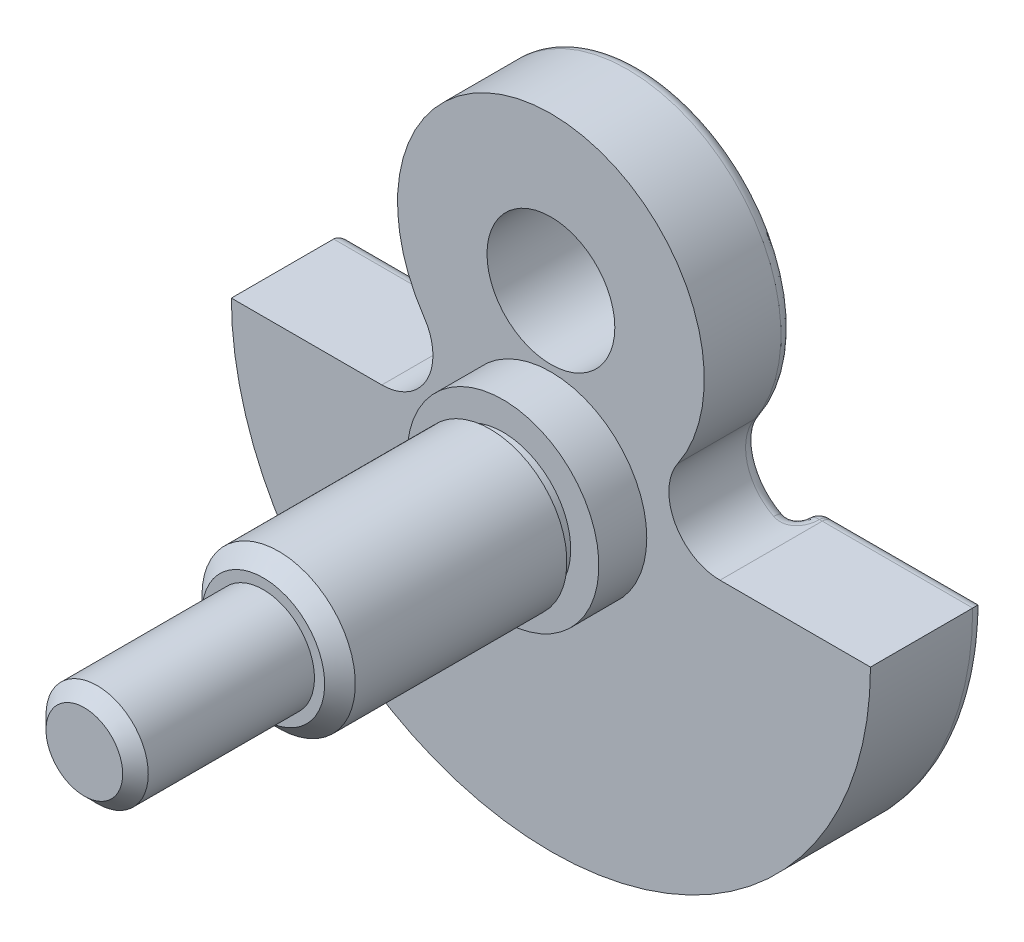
ISO-10303-21;
HEADER;
FILE_DESCRIPTION(('STEP AP214'),'2;1');
FILE_NAME('part.step','',(''),(''),'','','');
FILE_SCHEMA(('AUTOMOTIVE_DESIGN { 1 0 10303 214 1 1 1 1 }'));
ENDSEC;
DATA;
#1=APPLICATION_CONTEXT('core data for automotive mechanical design processes');
#2=APPLICATION_PROTOCOL_DEFINITION('international standard','automotive_design',2000,#1);
#3=PRODUCT_CONTEXT('',#1,'mechanical');
#4=PRODUCT('Part','Part','',(#3));
#5=PRODUCT_RELATED_PRODUCT_CATEGORY('part','',(#4));
#6=PRODUCT_DEFINITION_FORMATION('','',#4);
#7=PRODUCT_DEFINITION_CONTEXT('part definition',#1,'design');
#8=PRODUCT_DEFINITION('design','',#6,#7);
#9=PRODUCT_DEFINITION_SHAPE('','',#8);
#10=(LENGTH_UNIT() NAMED_UNIT(*) SI_UNIT(.MILLI.,.METRE.));
#11=(NAMED_UNIT(*) PLANE_ANGLE_UNIT() SI_UNIT($,.RADIAN.));
#12=(NAMED_UNIT(*) SI_UNIT($,.STERADIAN.) SOLID_ANGLE_UNIT());
#13=UNCERTAINTY_MEASURE_WITH_UNIT(LENGTH_MEASURE(1.E-05),#10,'distance_accuracy_value','');
#14=(GEOMETRIC_REPRESENTATION_CONTEXT(3) GLOBAL_UNCERTAINTY_ASSIGNED_CONTEXT((#13)) GLOBAL_UNIT_ASSIGNED_CONTEXT((#10,
#11,#12)) REPRESENTATION_CONTEXT('',''));
#15=CARTESIAN_POINT('',(0.,0.,0.));
#16=DIRECTION('',(0.,0.,1.));
#17=DIRECTION('',(1.,0.,0.));
#18=AXIS2_PLACEMENT_3D('',#15,#16,#17);
#19=CARTESIAN_POINT('',(0.,12.9999999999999,-1.5));
#20=DIRECTION('',(0.,0.,-1.));
#21=DIRECTION('',(-1.,0.,0.));
#22=AXIS2_PLACEMENT_3D('',#19,#20,#21);
#23=PLANE('',#22);
#24=CARTESIAN_POINT('',(0.,26.,-1.5));
#25=DIRECTION('',(0.,0.,-1.));
#26=DIRECTION('',(-1.,0.,0.));
#27=AXIS2_PLACEMENT_3D('',#24,#25,#26);
#28=CIRCLE('',#27,19.6733200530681);
#29=CARTESIAN_POINT('',(-19.6733200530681,26.,-1.5));
#30=VERTEX_POINT('',#29);
#31=EDGE_CURVE('E11',#30,#30,#28,.F.);
#32=ORIENTED_EDGE('',*,*,#31,.T.);
#33=EDGE_LOOP('',(#32));
#34=FACE_BOUND('',#33,.T.);
#35=CARTESIAN_POINT('',(0.,0.,-1.5));
#36=DIRECTION('',(0.,0.,-1.));
#37=DIRECTION('',(-1.,0.,0.));
#38=AXIS2_PLACEMENT_3D('',#35,#36,#37);
#39=CIRCLE('',#38,22.);
#40=CARTESIAN_POINT('',(21.9798446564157,-0.941503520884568,-1.49999999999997));
#41=VERTEX_POINT('',#40);
#42=CARTESIAN_POINT('',(-21.9798446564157,-0.941503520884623,-1.5));
#43=VERTEX_POINT('',#42);
#44=EDGE_CURVE('E48',#41,#43,#39,.T.);
#45=ORIENTED_EDGE('',*,*,#44,.T.);
#46=CARTESIAN_POINT('',(-26.4575131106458,8.00000000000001,-1.5));
#47=DIRECTION('',(0.,0.,-1.));
#48=DIRECTION('',(-1.,0.,0.));
#49=AXIS2_PLACEMENT_3D('',#46,#47,#48);
#50=CIRCLE('',#49,10.);
#51=CARTESIAN_POINT('',(-18.189540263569,13.625,-1.49999999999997));
#52=VERTEX_POINT('',#51);
#53=EDGE_CURVE('E224',#43,#52,#50,.F.);
#54=ORIENTED_EDGE('',*,*,#53,.T.);
#55=CARTESIAN_POINT('',(0.,26.,-1.5));
#56=DIRECTION('',(0.,0.,-1.));
#57=DIRECTION('',(-1.,0.,0.));
#58=AXIS2_PLACEMENT_3D('',#55,#56,#57);
#59=CIRCLE('',#58,22.);
#60=CARTESIAN_POINT('',(18.189540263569,13.625,-1.49999999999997));
#61=VERTEX_POINT('',#60);
#62=EDGE_CURVE('E220',#52,#61,#59,.T.);
#63=ORIENTED_EDGE('',*,*,#62,.T.);
#64=CARTESIAN_POINT('',(26.4575131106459,8.00000000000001,-1.49999999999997));
#65=DIRECTION('',(0.,0.,-1.));
#66=DIRECTION('',(-1.,0.,0.));
#67=AXIS2_PLACEMENT_3D('',#64,#65,#66);
#68=CIRCLE('',#67,10.);
#69=EDGE_CURVE('E53',#61,#41,#68,.F.);
#70=ORIENTED_EDGE('',*,*,#69,.T.);
#71=EDGE_LOOP('',(#45,#54,#63,#70));
#72=FACE_BOUND('',#71,.T.);
#73=ADVANCED_FACE('F32',(#34,#72),#23,.T.);
#74=CARTESIAN_POINT('',(0.,26.,-5.50000000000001));
#75=DIRECTION('',(0.,0.,1.));
#76=DIRECTION('',(1.,0.,0.));
#77=AXIS2_PLACEMENT_3D('',#74,#75,#76);
#78=CYLINDRICAL_SURFACE('',#77,24.);
#79=DIRECTION('',(0.,0.,1.));
#80=VECTOR('',#79,1.);
#81=CARTESIAN_POINT('',(19.8431348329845,12.5,-5.50000000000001));
#82=LINE('',#81,#80);
#83=CARTESIAN_POINT('',(19.8431348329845,12.5,0.5));
#84=VERTEX_POINT('',#83);
#85=CARTESIAN_POINT('',(19.8431348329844,12.5,12.5));
#86=VERTEX_POINT('',#85);
#87=EDGE_CURVE('E447',#84,#86,#82,.T.);
#88=ORIENTED_EDGE('',*,*,#87,.F.);
#89=CARTESIAN_POINT('',(0.,26.,0.5));
#90=DIRECTION('',(0.,0.,-1.));
#91=DIRECTION('',(-1.,0.,0.));
#92=AXIS2_PLACEMENT_3D('',#89,#90,#91);
#93=CIRCLE('',#92,24.);
#94=CARTESIAN_POINT('',(-19.8431348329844,12.5,0.5));
#95=VERTEX_POINT('',#94);
#96=EDGE_CURVE('E226',#84,#95,#93,.F.);
#97=ORIENTED_EDGE('',*,*,#96,.T.);
#98=DIRECTION('',(0.,0.,1.));
#99=VECTOR('',#98,1.);
#100=CARTESIAN_POINT('',(-19.8431348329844,12.5,-5.50000000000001));
#101=LINE('',#100,#99);
#102=CARTESIAN_POINT('',(-19.8431348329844,12.5,12.5));
#103=VERTEX_POINT('',#102);
#104=EDGE_CURVE('E445',#95,#103,#101,.T.);
#105=ORIENTED_EDGE('',*,*,#104,.T.);
#106=CARTESIAN_POINT('',(1.11022302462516E-13,26.,12.5));
#107=DIRECTION('',(0.,0.,1.));
#108=DIRECTION('',(1.,0.,0.));
#109=AXIS2_PLACEMENT_3D('',#106,#107,#108);
#110=CIRCLE('',#109,24.);
#111=EDGE_CURVE('E431',#86,#103,#110,.T.);
#112=ORIENTED_EDGE('',*,*,#111,.F.);
#113=EDGE_LOOP('',(#88,#97,#105,#112));
#114=FACE_BOUND('',#113,.T.);
#115=ADVANCED_FACE('F204',(#114),#78,.T.);
#116=CARTESIAN_POINT('',(1.11022302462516E-13,0.,-5.50000000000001));
#117=DIRECTION('',(0.,0.,1.));
#118=DIRECTION('',(1.,0.,0.));
#119=AXIS2_PLACEMENT_3D('',#116,#117,#118);
#120=CYLINDRICAL_SURFACE('',#119,50.);
#121=DIRECTION('',(0.,0.,1.));
#122=VECTOR('',#121,1.);
#123=CARTESIAN_POINT('',(-50.,0.,-5.50000000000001));
#124=LINE('',#123,#122);
#125=CARTESIAN_POINT('',(-50.,0.,-3.5));
#126=VERTEX_POINT('',#125);
#127=CARTESIAN_POINT('',(-49.9999999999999,0.,12.5));
#128=VERTEX_POINT('',#127);
#129=EDGE_CURVE('E441',#126,#128,#124,.T.);
#130=ORIENTED_EDGE('',*,*,#129,.F.);
#131=CARTESIAN_POINT('',(0.,0.,-3.5));
#132=DIRECTION('',(0.,0.,1.));
#133=DIRECTION('',(1.,0.,0.));
#134=AXIS2_PLACEMENT_3D('',#131,#132,#133);
#135=CIRCLE('',#134,50.);
#136=CARTESIAN_POINT('',(50.0000000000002,0.,-3.5));
#137=VERTEX_POINT('',#136);
#138=EDGE_CURVE('E332',#126,#137,#135,.T.);
#139=ORIENTED_EDGE('',*,*,#138,.T.);
#140=DIRECTION('',(0.,0.,1.));
#141=VECTOR('',#140,1.);
#142=CARTESIAN_POINT('',(50.0000000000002,0.,-5.50000000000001));
#143=LINE('',#142,#141);
#144=CARTESIAN_POINT('',(50.,0.,12.5));
#145=VERTEX_POINT('',#144);
#146=EDGE_CURVE('E440',#137,#145,#143,.T.);
#147=ORIENTED_EDGE('',*,*,#146,.T.);
#148=CARTESIAN_POINT('',(0.,0.,12.5));
#149=DIRECTION('',(0.,0.,1.));
#150=DIRECTION('',(1.,0.,0.));
#151=AXIS2_PLACEMENT_3D('',#148,#149,#150);
#152=CIRCLE('',#151,50.);
#153=EDGE_CURVE('E422',#128,#145,#152,.T.);
#154=ORIENTED_EDGE('',*,*,#153,.F.);
#155=EDGE_LOOP('',(#130,#139,#147,#154));
#156=FACE_BOUND('',#155,.T.);
#157=ADVANCED_FACE('F297',(#156),#120,.T.);
#158=CARTESIAN_POINT('',(-50.,0.,-5.50000000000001));
#159=DIRECTION('',(0.,1.,0.));
#160=DIRECTION('',(-1.,0.,0.));
#161=AXIS2_PLACEMENT_3D('',#158,#159,#160);
#162=PLANE('',#161);
#163=DIRECTION('',(0.,0.,1.));
#164=VECTOR('',#163,1.);
#165=CARTESIAN_POINT('',(-26.4575131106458,0.,-5.50000000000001));
#166=LINE('',#165,#164);
#167=CARTESIAN_POINT('',(-26.4575131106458,0.,-3.5));
#168=VERTEX_POINT('',#167);
#169=CARTESIAN_POINT('',(-26.4575131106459,0.,12.5));
#170=VERTEX_POINT('',#169);
#171=EDGE_CURVE('E443',#168,#170,#166,.T.);
#172=ORIENTED_EDGE('',*,*,#171,.F.);
#173=DIRECTION('',(-1.,0.,0.));
#174=VECTOR('',#173,1.);
#175=CARTESIAN_POINT('',(-50.,0.,-3.5));
#176=LINE('',#175,#174);
#177=EDGE_CURVE('E350',#168,#126,#176,.T.);
#178=ORIENTED_EDGE('',*,*,#177,.T.);
#179=ORIENTED_EDGE('',*,*,#129,.T.);
#180=DIRECTION('',(-1.,0.,0.));
#181=VECTOR('',#180,1.);
#182=CARTESIAN_POINT('',(-49.9999999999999,0.,12.5));
#183=LINE('',#182,#181);
#184=EDGE_CURVE('E437',#170,#128,#183,.T.);
#185=ORIENTED_EDGE('',*,*,#184,.F.);
#186=EDGE_LOOP('',(#172,#178,#179,#185));
#187=FACE_BOUND('',#186,.T.);
#188=ADVANCED_FACE('F201',(#187),#162,.T.);
#189=CARTESIAN_POINT('',(-26.4575131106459,7.9999999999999,-5.50000000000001));
#190=DIRECTION('',(0.,0.,1.));
#191=DIRECTION('',(1.,0.,0.));
#192=AXIS2_PLACEMENT_3D('',#189,#190,#191);
#193=CYLINDRICAL_SURFACE('',#192,8.);
#194=CARTESIAN_POINT('',(-21.2024544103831,0.041244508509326,-1.6658830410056));
#195=CARTESIAN_POINT('',(-22.0217569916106,1.32283175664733,-1.30855290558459));
#196=CARTESIAN_POINT('',(-21.6154629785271,1.63175451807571,0.168233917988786));
#197=CARTESIAN_POINT('',(-21.2617438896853,-0.0524518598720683,-1.6401808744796));
#198=CARTESIAN_POINT('',(-22.1057490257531,1.26857123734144,-1.30633330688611));
#199=CARTESIAN_POINT('',(-21.7101727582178,1.55972222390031,0.219638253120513));
#200=CARTESIAN_POINT('',(-21.3224547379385,-0.143662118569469,-1.6169895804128));
#201=CARTESIAN_POINT('',(-22.1870700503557,1.21866100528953,-1.3095667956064));
#202=CARTESIAN_POINT('',(-21.8076828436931,1.4889364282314,0.266020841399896));
#203=CARTESIAN_POINT('',(-21.4467298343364,-0.320522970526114,-1.57626802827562));
#204=CARTESIAN_POINT('',(-22.3446473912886,1.12580897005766,-1.32550103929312));
#205=CARTESIAN_POINT('',(-22.0080906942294,1.35037968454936,0.347463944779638));
#206=CARTESIAN_POINT('',(-21.5103004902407,-0.406159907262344,-1.55875128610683));
#207=CARTESIAN_POINT('',(-22.4207047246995,1.08307246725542,-1.33840222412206));
#208=CARTESIAN_POINT('',(-22.1110006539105,1.28261626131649,0.382497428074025));
#209=CARTESIAN_POINT('',(-21.6403162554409,-0.571206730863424,-1.53008182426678));
#210=CARTESIAN_POINT('',(-22.5656661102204,1.00437093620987,-1.37254201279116));
#211=CARTESIAN_POINT('',(-22.3220172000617,1.15067690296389,0.439836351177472));
#212=CARTESIAN_POINT('',(-21.7067730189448,-0.650586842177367,-1.51895811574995));
#213=CARTESIAN_POINT('',(-22.6342664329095,0.96863894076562,-1.39394553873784));
#214=CARTESIAN_POINT('',(-22.4301450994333,1.08651849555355,0.462083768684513));
#215=CARTESIAN_POINT('',(-21.8418212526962,-0.801816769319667,-1.50391900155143));
#216=CARTESIAN_POINT('',(-22.7623106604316,0.903271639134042,-1.44298613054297));
#217=CARTESIAN_POINT('',(-22.6501713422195,0.962950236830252,0.492161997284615));
#218=CARTESIAN_POINT('',(-21.9104103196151,-0.873674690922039,-1.49999575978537));
#219=CARTESIAN_POINT('',(-22.8214553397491,0.873812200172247,-1.47066686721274));
#220=CARTESIAN_POINT('',(-22.7620654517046,0.903535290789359,0.500008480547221));
#221=CARTESIAN_POINT('',(-22.0776034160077,-1.03700183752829,-1.5000059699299));
#222=CARTESIAN_POINT('',(-22.9526632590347,0.808078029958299,-1.54204158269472));
#223=CARTESIAN_POINT('',(-23.0349150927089,0.766913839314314,0.499988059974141));
#224=CARTESIAN_POINT('',(-22.1770377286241,-1.1245134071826,-1.50779726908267));
#225=CARTESIAN_POINT('',(-23.0188573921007,0.774563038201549,-1.58727252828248));
#226=CARTESIAN_POINT('',(-23.1972642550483,0.692336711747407,0.484405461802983));
#227=CARTESIAN_POINT('',(-22.376349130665,-1.28196435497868,-1.54028325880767));
#228=CARTESIAN_POINT('',(-23.1353937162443,0.710923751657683,-1.67860445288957));
#229=CARTESIAN_POINT('',(-23.5223948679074,0.555801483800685,0.419433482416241));
#230=CARTESIAN_POINT('',(-22.4762238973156,-1.35195727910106,-1.56492556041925));
#231=CARTESIAN_POINT('',(-23.1851208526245,0.681074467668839,-1.72437705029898));
#232=CARTESIAN_POINT('',(-23.68517342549,0.493805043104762,0.370148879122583));
#233=CARTESIAN_POINT('',(-22.6738609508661,-1.4749859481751,-1.63163902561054));
#234=CARTESIAN_POINT('',(-23.2773424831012,0.619965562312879,-1.81491313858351));
#235=CARTESIAN_POINT('',(-24.0067622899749,0.382725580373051,0.236721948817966));
#236=CARTESIAN_POINT('',(-22.7716136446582,-1.52795549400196,-1.67377680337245));
#237=CARTESIAN_POINT('',(-23.3193957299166,0.588929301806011,-1.8593112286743));
#238=CARTESIAN_POINT('',(-24.1655549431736,0.333693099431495,0.152446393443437));
#239=CARTESIAN_POINT('',(-22.961038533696,-1.61799087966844,-1.77492540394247));
#240=CARTESIAN_POINT('',(-23.4044581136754,0.524288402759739,-1.95044136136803));
#241=CARTESIAN_POINT('',(-24.4726835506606,0.248489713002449,-0.0498508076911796));
#242=CARTESIAN_POINT('',(-23.0527050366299,-1.65504200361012,-1.83395175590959));
#243=CARTESIAN_POINT('',(-23.4471865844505,0.49089524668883,-1.9968739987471));
#244=CARTESIAN_POINT('',(-24.6210097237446,0.212330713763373,-0.167903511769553));
#245=CARTESIAN_POINT('',(-23.2227997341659,-1.71450111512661,-1.96456029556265));
#246=CARTESIAN_POINT('',(-23.5354030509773,0.425079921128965,-2.09667086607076));
#247=CARTESIAN_POINT('',(-24.8957488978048,0.15271462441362,-0.429120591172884));
#248=CARTESIAN_POINT('',(-23.3016158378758,-1.73744562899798,-2.03553080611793));
#249=CARTESIAN_POINT('',(-23.5804930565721,0.39281859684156,-2.14941374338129));
#250=CARTESIAN_POINT('',(-25.0228096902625,0.128798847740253,-0.571061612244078));
#251=CARTESIAN_POINT('',(-23.4476939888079,-1.77384538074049,-2.18959944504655));
#252=CARTESIAN_POINT('',(-23.6729591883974,0.331032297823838,-2.26825866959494));
#253=CARTESIAN_POINT('',(-25.2579609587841,0.0895441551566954,-0.879198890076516));
#254=CARTESIAN_POINT('',(-23.5149572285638,-1.78730159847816,-2.27269632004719));
#255=CARTESIAN_POINT('',(-23.7202257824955,0.301545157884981,-2.33413353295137));
#256=CARTESIAN_POINT('',(-25.3660533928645,0.0742043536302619,-1.04539264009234));
#257=CARTESIAN_POINT('',(-23.6369518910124,-1.80783044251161,-2.4504606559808));
#258=CARTESIAN_POINT('',(-23.8127226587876,0.247446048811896,-2.48269535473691));
#259=CARTESIAN_POINT('',(-25.5618785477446,0.0496669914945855,-1.40092131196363));
#260=CARTESIAN_POINT('',(-23.6914201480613,-1.81477656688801,-2.54531839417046));
#261=CARTESIAN_POINT('',(-23.8579346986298,0.222880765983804,-2.56554934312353));
#262=CARTESIAN_POINT('',(-25.6491841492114,0.0405920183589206,-1.59063678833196));
#263=CARTESIAN_POINT('',(-23.7844194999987,-1.82458402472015,-2.74270656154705));
#264=CARTESIAN_POINT('',(-23.9389415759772,0.181000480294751,-2.74582050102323));
#265=CARTESIAN_POINT('',(-25.7981340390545,0.0268679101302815,-1.98541312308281));
#266=CARTESIAN_POINT('',(-23.8229504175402,-1.82744531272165,-2.84523707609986));
#267=CARTESIAN_POINT('',(-23.9748840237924,0.163589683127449,-2.84327562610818));
#268=CARTESIAN_POINT('',(-25.8597780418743,0.0222188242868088,-2.1904741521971));
#269=CARTESIAN_POINT('',(-23.883626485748,-1.83122630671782,-3.05786954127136));
#270=CARTESIAN_POINT('',(-24.0327593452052,0.136340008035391,-3.05101492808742));
#271=CARTESIAN_POINT('',(-25.9568107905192,0.0155307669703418,-2.61573908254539));
#272=CARTESIAN_POINT('',(-23.9053370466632,-1.83209558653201,-3.16809681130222));
#273=CARTESIAN_POINT('',(-24.054502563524,0.126609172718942,-3.16183096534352));
#274=CARTESIAN_POINT('',(-25.9915032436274,0.0135600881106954,-2.83619362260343));
#275=CARTESIAN_POINT('',(-23.9300435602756,-1.83304319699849,-3.39063950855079));
#276=CARTESIAN_POINT('',(-24.0792369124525,0.11558467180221,-3.38774466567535));
#277=CARTESIAN_POINT('',(-26.0309807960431,0.0113540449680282,-3.28127901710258));
#278=CARTESIAN_POINT('',(-23.9330350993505,-1.83312134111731,-3.50295542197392));
#279=CARTESIAN_POINT('',(-24.0823173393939,0.114251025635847,-3.50325880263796));
#280=CARTESIAN_POINT('',(-26.0357588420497,0.0111190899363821,-3.50591084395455));
#281=CARTESIAN_POINT('',(-23.920146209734,-1.83267102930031,-3.7269945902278));
#282=CARTESIAN_POINT('',(-24.0693268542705,0.119996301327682,-3.73187641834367));
#283=CARTESIAN_POINT('',(-26.0151666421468,0.0122313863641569,-3.95398918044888));
#284=CARTESIAN_POINT('',(-23.9041928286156,-1.83214022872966,-3.83871387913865));
#285=CARTESIAN_POINT('',(-24.053130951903,0.127130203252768,-3.84541224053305));
#286=CARTESIAN_POINT('',(-25.9896798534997,0.0135847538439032,-4.17742775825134));
#287=CARTESIAN_POINT('',(-23.8664593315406,-1.83014839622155,-4.00303142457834));
#288=CARTESIAN_POINT('',(-24.0164756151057,0.144016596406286,-4.00827889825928));
#289=CARTESIAN_POINT('',(-25.9293567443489,0.0174302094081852,-4.50606284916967));
#290=CARTESIAN_POINT('',(-23.8515634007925,-1.82928400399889,-4.0573026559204));
#291=CARTESIAN_POINT('',(-24.0021278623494,0.150708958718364,-4.06153009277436));
#292=CARTESIAN_POINT('',(-25.90553885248,0.0190166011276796,-4.61460531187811));
#293=CARTESIAN_POINT('',(-23.8172912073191,-1.82691206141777,-4.16439928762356));
#294=CARTESIAN_POINT('',(-23.9698873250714,0.166116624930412,-4.16505089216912));
#295=CARTESIAN_POINT('',(-25.8507177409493,0.0229994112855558,-4.82879857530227));
#296=CARTESIAN_POINT('',(-23.7979147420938,-1.82540448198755,-4.21722462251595));
#297=CARTESIAN_POINT('',(-23.9519711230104,0.174844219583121,-4.21534764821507));
#298=CARTESIAN_POINT('',(-25.8197141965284,0.0253958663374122,-4.93444924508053));
#299=CARTESIAN_POINT('',(-23.7763631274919,-1.82345348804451,-4.26916167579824));
#300=CARTESIAN_POINT('',(-23.9326287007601,0.184538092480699,-4.26373152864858));
#301=CARTESIAN_POINT('',(-25.7852148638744,0.0282991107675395,-5.03832335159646));
#302=(BOUNDED_SURFACE() B_SPLINE_SURFACE(3,2,((#194,#195,#196),(#197,#198,#199),(#200,#201,
#202),(#203,#204,#205),(#206,#207,#208),(#209,#210,#211),(#212,#213,#214),(#215,#216,#217),
(#218,#219,#220),(#221,#222,#223),(#224,#225,#226),(#227,#228,#229),(#230,#231,#232),(#233,#234,
#235),(#236,#237,#238),(#239,#240,#241),(#242,#243,#244),(#245,#246,#247),(#248,#249,#250),
(#251,#252,#253),(#254,#255,#256),(#257,#258,#259),(#260,#261,#262),(#263,#264,#265),(#266,#267,
#268),(#269,#270,#271),(#272,#273,#274),(#275,#276,#277),(#278,#279,#280),(#281,#282,#283),
(#284,#285,#286),(#287,#288,#289),(#290,#291,#292),(#293,#294,#295),(#296,#297,#298),(#299,#300,
#301)),.UNSPECIFIED.,.F.,.F.,.F.) B_SPLINE_SURFACE_WITH_KNOTS((4,2,2,2,2,2,2,2,2,2,2,2,2,2,2,2,
2,4),(3,3),(0.,0.472133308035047,0.945383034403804,1.42076371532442,1.89562674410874,
2.56420115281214,3.23070638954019,3.89977296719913,4.56945674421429,5.21177343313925,
5.85402377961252,6.50851003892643,7.16300358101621,7.83389032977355,8.50493525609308,
9.17857261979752,9.51593372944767,9.85331008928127),(0.,1.),
.UNSPECIFIED.) GEOMETRIC_REPRESENTATION_ITEM() RATIONAL_B_SPLINE_SURFACE(((1.,0.788024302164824,
1.),(1.,0.780395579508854,1.),(1.,0.772842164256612,1.),(1.,0.758093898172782,1.),(1.,
0.750899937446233,1.),(1.,0.737085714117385,1.),(1.,0.730468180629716,1.),(1.,0.718091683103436,
1.),(1.,0.712331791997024,1.),(1.,0.699750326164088,1.),(1.,0.693454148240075,1.),(1.,
0.683439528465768,1.),(1.,0.679713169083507,1.),(1.,0.674842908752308,1.),(1.,0.673708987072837,
1.),(1.,0.673670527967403,1.),(1.,0.674768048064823,1.),(1.,0.678413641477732,1.),(1.,
0.68090060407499,1.),(1.,0.68654940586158,1.),(1.,0.689711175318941,1.),(1.,0.696079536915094,
1.),(1.,0.699285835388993,1.),(1.,0.705081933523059,1.),(1.,0.707671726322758,1.),(1.,
0.711859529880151,1.),(1.,0.713431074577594,1.),(1.,0.715225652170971,1.),(1.,0.715448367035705,
1.),(1.,0.714505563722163,1.),(1.,0.71333467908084,1.),(1.,0.710675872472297,1.),(1.,
0.709637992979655,1.),(1.,0.707308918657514,1.),(1.,0.706017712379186,1.),(1.,0.704623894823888,1.))) REPRESENTATION_ITEM('') SURFACE());
#303=CARTESIAN_POINT('',(-25.7852148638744,0.0282991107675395,-5.03832335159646));
#304=CARTESIAN_POINT('',(-25.8197141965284,0.0253958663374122,-4.93444924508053));
#305=CARTESIAN_POINT('',(-25.8507177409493,0.0229994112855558,-4.82879857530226));
#306=CARTESIAN_POINT('',(-25.90553885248,0.0190166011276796,-4.61460531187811));
#307=CARTESIAN_POINT('',(-25.9293567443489,0.0174302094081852,-4.50606284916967));
#308=CARTESIAN_POINT('',(-25.9896798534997,0.0135847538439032,-4.17742775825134));
#309=CARTESIAN_POINT('',(-26.0151666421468,0.0122313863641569,-3.95398918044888));
#310=CARTESIAN_POINT('',(-26.0357588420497,0.0111190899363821,-3.50591084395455));
#311=CARTESIAN_POINT('',(-26.0309807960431,0.0113540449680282,-3.28127901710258));
#312=CARTESIAN_POINT('',(-25.9915032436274,0.0135600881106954,-2.83619362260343));
#313=CARTESIAN_POINT('',(-25.9568107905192,0.0155307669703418,-2.61573908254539));
#314=CARTESIAN_POINT('',(-25.8597780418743,0.0222188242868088,-2.1904741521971));
#315=CARTESIAN_POINT('',(-25.7981340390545,0.0268679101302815,-1.98541312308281));
#316=CARTESIAN_POINT('',(-25.6491841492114,0.0405920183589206,-1.59063678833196));
#317=CARTESIAN_POINT('',(-25.5618785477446,0.0496669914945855,-1.40092131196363));
#318=CARTESIAN_POINT('',(-25.3660533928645,0.0742043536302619,-1.04539264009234));
#319=CARTESIAN_POINT('',(-25.2579609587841,0.0895441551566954,-0.879198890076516));
#320=CARTESIAN_POINT('',(-25.0228096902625,0.128798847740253,-0.571061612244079));
#321=CARTESIAN_POINT('',(-24.8957488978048,0.15271462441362,-0.429120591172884));
#322=CARTESIAN_POINT('',(-24.6210097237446,0.212330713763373,-0.167903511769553));
#323=CARTESIAN_POINT('',(-24.4726835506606,0.248489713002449,-0.0498508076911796));
#324=CARTESIAN_POINT('',(-24.1655549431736,0.333693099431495,0.152446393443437));
#325=CARTESIAN_POINT('',(-24.0067622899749,0.382725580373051,0.236721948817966));
#326=CARTESIAN_POINT('',(-23.68517342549,0.493805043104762,0.370148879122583));
#327=CARTESIAN_POINT('',(-23.5223948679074,0.555801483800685,0.419433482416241));
#328=CARTESIAN_POINT('',(-23.1972642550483,0.692336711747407,0.484405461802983));
#329=CARTESIAN_POINT('',(-23.0349150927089,0.766913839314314,0.499988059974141));
#330=CARTESIAN_POINT('',(-22.7620654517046,0.903535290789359,0.500008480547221));
#331=CARTESIAN_POINT('',(-22.6501713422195,0.962950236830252,0.492161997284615));
#332=CARTESIAN_POINT('',(-22.4301450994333,1.08651849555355,0.462083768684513));
#333=CARTESIAN_POINT('',(-22.3220172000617,1.15067690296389,0.439836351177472));
#334=CARTESIAN_POINT('',(-22.1110006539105,1.28261626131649,0.382497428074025));
#335=CARTESIAN_POINT('',(-22.0080906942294,1.35037968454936,0.347463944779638));
#336=CARTESIAN_POINT('',(-21.8076828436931,1.4889364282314,0.266020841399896));
#337=CARTESIAN_POINT('',(-21.7101727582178,1.55972222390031,0.219638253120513));
#338=CARTESIAN_POINT('',(-21.6154629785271,1.63175451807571,0.168233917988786));
#339=B_SPLINE_CURVE_WITH_KNOTS('',3,(#303,#304,#305,#306,#307,#308,#309,#310,#311,#312,#313,
#314,#315,#316,#317,#318,#319,#320,#321,#322,#323,#324,#325,#326,#327,#328,#329,#330,#331,#332,
#333,#334,#335,#336,#337,#338),.UNSPECIFIED.,.F.,.F.,(4,2,2,2,2,2,2,2,2,2,2,2,2,2,2,2,2,4),(0.,
0.337376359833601,0.674737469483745,1.34837483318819,2.01941975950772,2.69030650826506,
3.34480005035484,3.99928630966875,4.64153665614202,5.28385334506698,5.95353712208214,
6.62260369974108,7.28910893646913,7.95768334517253,8.43254637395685,8.90792705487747,
9.38117678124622,9.85331008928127),.UNSPECIFIED.);
#340=CARTESIAN_POINT('',(-26.030748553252,0.0113911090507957,-3.5));
#341=VERTEX_POINT('',#340);
#342=CARTESIAN_POINT('',(-22.8753783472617,0.846797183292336,0.5));
#343=VERTEX_POINT('',#342);
#344=EDGE_CURVE('E208',#341,#343,#339,.T.);
#345=ORIENTED_EDGE('',*,*,#344,.F.);
#346=CARTESIAN_POINT('',(-26.4575131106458,8.00000000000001,-3.5));
#347=DIRECTION('',(0.,0.,1.));
#348=DIRECTION('',(1.,0.,0.));
#349=AXIS2_PLACEMENT_3D('',#346,#347,#348);
#350=CIRCLE('',#349,8.);
#351=EDGE_CURVE('E218',#341,#168,#350,.F.);
#352=ORIENTED_EDGE('',*,*,#351,.T.);
#353=ORIENTED_EDGE('',*,*,#171,.T.);
#354=CARTESIAN_POINT('',(-26.4575131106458,7.99999999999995,12.5));
#355=DIRECTION('',(0.,0.,-1.));
#356=DIRECTION('',(1.,0.,0.));
#357=AXIS2_PLACEMENT_3D('',#354,#355,#356);
#358=CIRCLE('',#357,8.);
#359=EDGE_CURVE('E434',#103,#170,#358,.T.);
#360=ORIENTED_EDGE('',*,*,#359,.F.);
#361=ORIENTED_EDGE('',*,*,#104,.F.);
#362=CARTESIAN_POINT('',(-26.4575131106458,8.00000000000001,0.5));
#363=DIRECTION('',(0.,0.,-1.));
#364=DIRECTION('',(-1.,0.,0.));
#365=AXIS2_PLACEMENT_3D('',#362,#363,#364);
#366=CIRCLE('',#365,8.);
#367=EDGE_CURVE('E214',#95,#343,#366,.T.);
#368=ORIENTED_EDGE('',*,*,#367,.T.);
#369=EDGE_LOOP('',(#345,#352,#353,#360,#361,#368));
#370=FACE_BOUND('',#369,.T.);
#371=ADVANCED_FACE('F195',(#370),#193,.F.);
#372=CARTESIAN_POINT('',(26.4575131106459,8.00000000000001,-5.49999999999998));
#373=DIRECTION('',(0.,0.,1.));
#374=DIRECTION('',(1.,0.,0.));
#375=AXIS2_PLACEMENT_3D('',#372,#373,#374);
#376=CYLINDRICAL_SURFACE('',#375,8.);
#377=DIRECTION('',(0.,0.,1.));
#378=VECTOR('',#377,1.);
#379=CARTESIAN_POINT('',(26.4575131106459,0.,-5.50000000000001));
#380=LINE('',#379,#378);
#381=CARTESIAN_POINT('',(26.4575131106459,0.,-3.5));
#382=VERTEX_POINT('',#381);
#383=CARTESIAN_POINT('',(26.4575131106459,0.,12.5));
#384=VERTEX_POINT('',#383);
#385=EDGE_CURVE('E449',#382,#384,#380,.T.);
#386=ORIENTED_EDGE('',*,*,#385,.F.);
#387=CARTESIAN_POINT('',(26.4575131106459,8.00000000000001,-3.49999999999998));
#388=DIRECTION('',(0.,0.,1.));
#389=DIRECTION('',(1.,0.,0.));
#390=AXIS2_PLACEMENT_3D('',#387,#388,#389);
#391=CIRCLE('',#390,8.);
#392=CARTESIAN_POINT('',(26.030748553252,0.0113911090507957,-3.5));
#393=VERTEX_POINT('',#392);
#394=EDGE_CURVE('E352',#382,#393,#391,.F.);
#395=ORIENTED_EDGE('',*,*,#394,.T.);
#396=CARTESIAN_POINT('',(23.8167286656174,-1.82681605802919,-4.16363524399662));
#397=CARTESIAN_POINT('',(23.9694972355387,0.166361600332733,-4.16395913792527));
#398=CARTESIAN_POINT('',(25.8498147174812,0.0231144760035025,-4.82727048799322));
#399=CARTESIAN_POINT('',(23.8353957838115,-1.82822127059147,-4.11041687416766));
#400=CARTESIAN_POINT('',(23.9868035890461,0.157971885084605,-4.11317452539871));
#401=CARTESIAN_POINT('',(25.8796805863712,0.0208463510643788,-4.72083374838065));
#402=CARTESIAN_POINT('',(23.8518206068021,-1.82927966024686,-4.05642974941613));
#403=CARTESIAN_POINT('',(24.0024176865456,0.150588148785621,-4.06065776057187));
#404=CARTESIAN_POINT('',(25.9059490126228,0.0190057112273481,-4.61285949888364));
#405=CARTESIAN_POINT('',(23.8800772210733,-1.83090528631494,-3.94726465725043));
#406=CARTESIAN_POINT('',(24.0296434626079,0.137913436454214,-3.95315343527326));
#407=CARTESIAN_POINT('',(25.9511292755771,0.0160092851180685,-4.39452931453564));
#408=CARTESIAN_POINT('',(23.8919094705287,-1.83147257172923,-3.892086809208));
#409=CARTESIAN_POINT('',(24.0412775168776,0.132611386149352,-3.89812988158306));
#410=CARTESIAN_POINT('',(25.9700418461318,0.014853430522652,-4.28417361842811));
#411=CARTESIAN_POINT('',(23.9203279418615,-1.83274032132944,-3.72545685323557));
#412=CARTESIAN_POINT('',(24.0693484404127,0.119919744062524,-3.73073158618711));
#413=CARTESIAN_POINT('',(26.0154604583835,0.0121604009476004,-3.95091370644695));
#414=CARTESIAN_POINT('',(23.9298990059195,-1.83301002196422,-3.6127280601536));
#415=CARTESIAN_POINT('',(24.07916501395,0.115647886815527,-3.61525038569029));
#416=CARTESIAN_POINT('',(26.0307483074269,0.0113913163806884,-3.72545612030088));
#417=CARTESIAN_POINT('',(23.9298992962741,-1.83301049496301,-3.38758034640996));
#418=CARTESIAN_POINT('',(24.0791644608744,0.11564793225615,-3.38506491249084));
#419=CARTESIAN_POINT('',(26.0307487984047,0.0113909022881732,-3.27516069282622));
#420=CARTESIAN_POINT('',(23.9203808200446,-1.83274273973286,-3.27516142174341));
#421=CARTESIAN_POINT('',(24.0694010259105,0.119896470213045,-3.26990460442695));
#422=CARTESIAN_POINT('',(26.0155449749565,0.0121553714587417,-3.05032284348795));
#423=CARTESIAN_POINT('',(23.8921301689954,-1.83148231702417,-3.10905463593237));
#424=CARTESIAN_POINT('',(24.0414960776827,0.132512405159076,-3.10301211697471));
#425=CARTESIAN_POINT('',(25.9703945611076,0.0148325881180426,-2.71810927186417));
#426=CARTESIAN_POINT('',(23.8803821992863,-1.83091892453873,-3.0540994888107));
#427=CARTESIAN_POINT('',(24.0299453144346,0.137776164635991,-3.04819985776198));
#428=CARTESIAN_POINT('',(25.9516166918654,0.0159803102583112,-2.60819897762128));
#429=CARTESIAN_POINT('',(23.8523195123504,-1.82931212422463,-2.94531696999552));
#430=CARTESIAN_POINT('',(24.0028911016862,0.150364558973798,-2.94105395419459));
#431=CARTESIAN_POINT('',(25.9067469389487,0.0189495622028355,-2.39063393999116));
#432=CARTESIAN_POINT('',(23.8360002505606,-1.82826823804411,-2.89149077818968));
#433=CARTESIAN_POINT('',(23.9873619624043,0.157701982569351,-2.88868688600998));
#434=CARTESIAN_POINT('',(25.8806477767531,0.0207717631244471,-2.2829815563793));
#435=CARTESIAN_POINT('',(23.7803913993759,-1.82407846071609,-2.73241307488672));
#436=CARTESIAN_POINT('',(23.9356336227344,0.182776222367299,-2.73624048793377));
#437=CARTESIAN_POINT('',(25.7916779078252,0.0275312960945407,-1.96482614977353));
#438=CARTESIAN_POINT('',(23.7344299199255,-1.81987448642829,-2.62944113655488));
#439=CARTESIAN_POINT('',(23.8943058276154,0.203575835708,-2.64108868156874));
#440=CARTESIAN_POINT('',(25.7181015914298,0.0337626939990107,-1.75888227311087));
#441=CARTESIAN_POINT('',(23.6262369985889,-1.80607908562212,-2.43274191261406));
#442=CARTESIAN_POINT('',(23.8045014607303,0.252153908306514,-2.46724337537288));
#443=CARTESIAN_POINT('',(25.5446818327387,0.0517755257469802,-1.36548382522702));
#444=CARTESIAN_POINT('',(23.5640075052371,-1.79648830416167,-2.33901352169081));
#445=CARTESIAN_POINT('',(23.7559041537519,0.28002590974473,-2.38859102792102));
#446=CARTESIAN_POINT('',(25.4448415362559,0.0635562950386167,-1.17802704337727));
#447=CARTESIAN_POINT('',(23.4603225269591,-1.7757219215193,-2.20767897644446));
#448=CARTESIAN_POINT('',(23.6828740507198,0.325199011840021,-2.28308858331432));
#449=CARTESIAN_POINT('',(25.2782187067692,0.0872012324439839,-0.915357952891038));
#450=CARTESIAN_POINT('',(23.4241219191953,-1.76775917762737,-2.16552061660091));
#451=CARTESIAN_POINT('',(23.6584791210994,0.340838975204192,-2.24997118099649));
#452=CARTESIAN_POINT('',(25.2200035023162,0.0960543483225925,-0.831041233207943));
#453=CARTESIAN_POINT('',(23.3485946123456,-1.74930713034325,-2.08450602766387));
#454=CARTESIAN_POINT('',(23.6101476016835,0.372906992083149,-2.18728820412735));
#455=CARTESIAN_POINT('',(25.0984431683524,0.116046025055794,-0.669012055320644));
#456=CARTESIAN_POINT('',(23.3092708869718,-1.73882021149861,-2.04564672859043));
#457=CARTESIAN_POINT('',(23.5862247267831,0.389329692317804,-2.1577505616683));
#458=CARTESIAN_POINT('',(25.0351029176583,0.12718242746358,-0.591293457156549));
#459=CARTESIAN_POINT('',(23.1870594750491,-1.70292666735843,-1.93440108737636));
#460=CARTESIAN_POINT('',(23.5157310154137,0.43925988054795,-2.07340499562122));
#461=CARTESIAN_POINT('',(24.8380706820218,0.164491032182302,-0.368802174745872));
#462=CARTESIAN_POINT('',(23.0998840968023,-1.67307907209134,-1.86728720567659));
#463=CARTESIAN_POINT('',(23.4707974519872,0.47319212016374,-2.02333184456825));
#464=CARTESIAN_POINT('',(24.6972910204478,0.194572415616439,-0.234574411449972));
#465=CARTESIAN_POINT('',(22.9201056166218,-1.59965886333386,-1.75090898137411));
#466=CARTESIAN_POINT('',(23.3852530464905,0.538730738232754,-1.92961063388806));
#467=CARTESIAN_POINT('',(24.4063722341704,0.266008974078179,-0.00181796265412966));
#468=CARTESIAN_POINT('',(22.8277206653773,-1.55649070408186,-1.701200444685));
#469=CARTESIAN_POINT('',(23.3447905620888,0.570199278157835,-1.88608369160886));
#470=CARTESIAN_POINT('',(24.256601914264,0.307027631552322,0.0975991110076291));
#471=CARTESIAN_POINT('',(22.6387663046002,-1.45432431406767,-1.61811554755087));
#472=CARTESIAN_POINT('',(23.2607704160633,0.631231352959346,-1.79848473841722));
#473=CARTESIAN_POINT('',(23.9497083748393,0.401537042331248,0.263768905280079));
#474=CARTESIAN_POINT('',(22.5421997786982,-1.39533685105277,-1.58472812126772));
#475=CARTESIAN_POINT('',(23.2175124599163,0.660592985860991,-1.75471499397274));
#476=CARTESIAN_POINT('',(23.7925902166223,0.4550193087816,0.330543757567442));
#477=CARTESIAN_POINT('',(22.3492696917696,-1.26161937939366,-1.53467316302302));
#478=CARTESIAN_POINT('',(23.1198403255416,0.719804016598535,-1.66617409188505));
#479=CARTESIAN_POINT('',(23.4782576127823,0.573566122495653,0.430653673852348));
#480=CARTESIAN_POINT('',(22.2529173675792,-1.18708487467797,-1.51781156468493));
#481=CARTESIAN_POINT('',(23.0660309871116,0.749422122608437,-1.62175466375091));
#482=CARTESIAN_POINT('',(23.3210665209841,0.638485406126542,0.464376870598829));
#483=CARTESIAN_POINT('',(22.0617668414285,-1.02221378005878,-1.49931187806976));
#484=CARTESIAN_POINT('',(22.9405800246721,0.814448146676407,-1.53541009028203));
#485=CARTESIAN_POINT('',(23.0090968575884,0.779348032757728,0.501376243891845));
#486=CARTESIAN_POINT('',(21.9669721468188,-0.931845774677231,-1.49770441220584));
#487=CARTESIAN_POINT('',(22.8695895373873,0.849568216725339,-1.49372073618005));
#488=CARTESIAN_POINT('',(22.8543237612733,0.85531324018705,0.504591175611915));
#489=CARTESIAN_POINT('',(21.7734677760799,-0.728829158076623,-1.50879390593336));
#490=CARTESIAN_POINT('',(22.7020838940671,0.933734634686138,-1.41673202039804));
#491=CARTESIAN_POINT('',(22.5387272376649,1.02306934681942,0.482412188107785));
#492=CARTESIAN_POINT('',(21.6750621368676,-0.614969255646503,-1.52265905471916));
#493=CARTESIAN_POINT('',(22.6047808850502,0.98324097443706,-1.38212599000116));
#494=CARTESIAN_POINT('',(22.3784278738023,1.11564347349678,0.454681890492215));
#495=CARTESIAN_POINT('',(21.5319288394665,-0.433776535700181,-1.55387080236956));
#496=CARTESIAN_POINT('',(22.4446967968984,1.06999896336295,-1.34388326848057));
#497=CARTESIAN_POINT('',(22.1460953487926,1.26056237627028,0.392258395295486));
#498=CARTESIAN_POINT('',(21.4850465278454,-0.371769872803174,-1.5659783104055));
#499=CARTESIAN_POINT('',(22.3897969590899,1.10052124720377,-1.3334759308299));
#500=CARTESIAN_POINT('',(22.0701374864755,1.30978132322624,0.368043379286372));
#501=CARTESIAN_POINT('',(21.3927639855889,-0.244569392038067,-1.59336905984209));
#502=CARTESIAN_POINT('',(22.2766710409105,1.16553633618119,-1.31776510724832));
#503=CARTESIAN_POINT('',(21.9210005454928,1.40999956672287,0.313261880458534));
#504=CARTESIAN_POINT('',(21.3473625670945,-0.1793782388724,-1.6086496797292));
#505=CARTESIAN_POINT('',(22.2185297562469,1.19995030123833,-1.31239200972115));
#506=CARTESIAN_POINT('',(21.8478192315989,1.46099736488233,0.282700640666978));
#507=CARTESIAN_POINT('',(21.3026928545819,-0.112707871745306,-1.62538578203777));
#508=CARTESIAN_POINT('',(22.1586711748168,1.23667328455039,-1.30977942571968));
#509=CARTESIAN_POINT('',(21.7760575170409,1.51278383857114,0.249228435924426));
#510=(BOUNDED_SURFACE() B_SPLINE_SURFACE(3,2,((#396,#397,#398),(#399,#400,#401),(#402,#403,
#404),(#405,#406,#407),(#408,#409,#410),(#411,#412,#413),(#414,#415,#416),(#417,#418,#419),
(#420,#421,#422),(#423,#424,#425),(#426,#427,#428),(#429,#430,#431),(#432,#433,#434),(#435,#436,
#437),(#438,#439,#440),(#441,#442,#443),(#444,#445,#446),(#447,#448,#449),(#450,#451,#452),
(#453,#454,#455),(#456,#457,#458),(#459,#460,#461),(#462,#463,#464),(#465,#466,#467),(#468,#469,
#470),(#471,#472,#473),(#474,#475,#476),(#477,#478,#479),(#480,#481,#482),(#483,#484,#485),
(#486,#487,#488),(#489,#490,#491),(#492,#493,#494),(#495,#496,#497),(#498,#499,#500),(#501,#502,
#503),(#504,#505,#506),(#507,#508,#509)),.UNSPECIFIED.,.F.,.F.,
.F.) B_SPLINE_SURFACE_WITH_KNOTS((4,2,2,2,2,2,2,2,2,2,2,2,2,2,2,2,2,2,4),(3,3),(0.,
0.33828694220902,0.676540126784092,1.35191511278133,2.02544237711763,2.36228739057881,
2.69946847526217,3.37310173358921,4.04665434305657,4.38206177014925,4.71715357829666,
5.38688324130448,6.03800176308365,6.68867820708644,7.33161864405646,7.97584950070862,
8.67221812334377,9.01911655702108,9.36572952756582),(0.,1.),
.UNSPECIFIED.) GEOMETRIC_REPRESENTATION_ITEM() RATIONAL_B_SPLINE_SURFACE(((1.,0.707279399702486,
1.),(1.,0.708530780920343,1.),(1.,0.709658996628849,1.),(1.,0.711629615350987,1.),(1.,
0.712472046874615,1.),(1.,0.714509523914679,1.),(1.,0.715219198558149,1.),(1.,0.715219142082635,
1.),(1.,0.714513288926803,1.),(1.,0.712487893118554,1.),(1.,0.711651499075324,1.),(1.,
0.709693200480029,1.),(1.,0.708571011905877,1.),(1.,0.704843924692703,1.),(1.,0.701876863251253,
1.),(1.,0.695513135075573,1.),(1.,0.692116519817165,1.),(1.,0.68725348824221,1.),(1.,
0.685674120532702,1.),(1.,0.682690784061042,1.),(1.,0.681286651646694,1.),(1.,0.677490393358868,
1.),(1.,0.675511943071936,1.),(1.,0.673485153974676,1.),(1.,0.673384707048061,1.),(1.,
0.675507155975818,1.),(1.,0.677728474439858,1.),(1.,0.68462921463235,1.),(1.,0.689279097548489,
1.),(1.,0.700829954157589,1.),(1.,0.707735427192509,1.),(1.,0.723957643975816,1.),(1.,
0.733424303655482,1.),(1.,0.748587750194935,1.),(1.,0.7537922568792,1.),(1.,0.764434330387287,
1.),(1.,0.769871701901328,1.),(1.,0.775383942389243,1.))) REPRESENTATION_ITEM('') SURFACE());
#511=CARTESIAN_POINT('',(21.7760575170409,1.51278383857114,0.249228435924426));
#512=CARTESIAN_POINT('',(21.8478192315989,1.46099736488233,0.282700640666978));
#513=CARTESIAN_POINT('',(21.9210005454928,1.40999956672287,0.313261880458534));
#514=CARTESIAN_POINT('',(22.0701374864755,1.30978132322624,0.368043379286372));
#515=CARTESIAN_POINT('',(22.1460953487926,1.26056237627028,0.392258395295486));
#516=CARTESIAN_POINT('',(22.3784278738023,1.11564347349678,0.454681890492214));
#517=CARTESIAN_POINT('',(22.5387272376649,1.02306934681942,0.482412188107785));
#518=CARTESIAN_POINT('',(22.8543237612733,0.85531324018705,0.504591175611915));
#519=CARTESIAN_POINT('',(23.0090968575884,0.779348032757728,0.501376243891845));
#520=CARTESIAN_POINT('',(23.3210665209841,0.638485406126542,0.464376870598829));
#521=CARTESIAN_POINT('',(23.4782576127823,0.573566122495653,0.430653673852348));
#522=CARTESIAN_POINT('',(23.7925902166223,0.4550193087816,0.330543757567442));
#523=CARTESIAN_POINT('',(23.9497083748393,0.401537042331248,0.263768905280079));
#524=CARTESIAN_POINT('',(24.256601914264,0.307027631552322,0.0975991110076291));
#525=CARTESIAN_POINT('',(24.4063722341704,0.266008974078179,-0.00181796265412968));
#526=CARTESIAN_POINT('',(24.6972910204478,0.194572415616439,-0.234574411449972));
#527=CARTESIAN_POINT('',(24.8380706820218,0.164491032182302,-0.368802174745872));
#528=CARTESIAN_POINT('',(25.0351029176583,0.12718242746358,-0.591293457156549));
#529=CARTESIAN_POINT('',(25.0984431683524,0.116046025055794,-0.669012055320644));
#530=CARTESIAN_POINT('',(25.2200035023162,0.0960543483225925,-0.831041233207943));
#531=CARTESIAN_POINT('',(25.2782187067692,0.0872012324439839,-0.915357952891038));
#532=CARTESIAN_POINT('',(25.4448415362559,0.0635562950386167,-1.17802704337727));
#533=CARTESIAN_POINT('',(25.5446818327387,0.0517755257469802,-1.36548382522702));
#534=CARTESIAN_POINT('',(25.7181015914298,0.0337626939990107,-1.75888227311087));
#535=CARTESIAN_POINT('',(25.7916779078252,0.0275312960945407,-1.96482614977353));
#536=CARTESIAN_POINT('',(25.8806477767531,0.0207717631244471,-2.2829815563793));
#537=CARTESIAN_POINT('',(25.9067469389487,0.0189495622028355,-2.39063393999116));
#538=CARTESIAN_POINT('',(25.9516166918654,0.0159803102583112,-2.60819897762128));
#539=CARTESIAN_POINT('',(25.9703945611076,0.0148325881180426,-2.71810927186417));
#540=CARTESIAN_POINT('',(26.0155449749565,0.0121553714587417,-3.05032284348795));
#541=CARTESIAN_POINT('',(26.0307487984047,0.0113909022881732,-3.27516069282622));
#542=CARTESIAN_POINT('',(26.0307483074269,0.0113913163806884,-3.72545612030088));
#543=CARTESIAN_POINT('',(26.0154604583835,0.0121604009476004,-3.95091370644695));
#544=CARTESIAN_POINT('',(25.9700418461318,0.014853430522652,-4.28417361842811));
#545=CARTESIAN_POINT('',(25.9511292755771,0.0160092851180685,-4.39452931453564));
#546=CARTESIAN_POINT('',(25.9059490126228,0.0190057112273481,-4.61285949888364));
#547=CARTESIAN_POINT('',(25.8796805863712,0.0208463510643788,-4.72083374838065));
#548=CARTESIAN_POINT('',(25.8498147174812,0.0231144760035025,-4.82727048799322));
#549=B_SPLINE_CURVE_WITH_KNOTS('',3,(#511,#512,#513,#514,#515,#516,#517,#518,#519,#520,#521,
#522,#523,#524,#525,#526,#527,#528,#529,#530,#531,#532,#533,#534,#535,#536,#537,#538,#539,#540,
#541,#542,#543,#544,#545,#546,#547,#548),.UNSPECIFIED.,.F.,.F.,(4,2,2,2,2,2,2,2,2,2,2,2,2,2,2,2,
2,2,4),(0.,0.346612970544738,0.693511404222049,1.3898800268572,2.03411088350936,
2.67705132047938,3.32772776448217,3.97884628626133,4.64857594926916,4.98366775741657,
5.31907518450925,5.99262779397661,6.66626105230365,7.00344213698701,7.34028715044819,
8.01381441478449,8.68918940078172,9.0274425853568,9.36572952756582),.UNSPECIFIED.);
#550=CARTESIAN_POINT('',(22.8753783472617,0.846797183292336,0.5));
#551=VERTEX_POINT('',#550);
#552=EDGE_CURVE('E354',#551,#393,#549,.T.);
#553=ORIENTED_EDGE('',*,*,#552,.F.);
#554=CARTESIAN_POINT('',(26.4575131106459,8.00000000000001,0.500000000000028));
#555=DIRECTION('',(0.,0.,-1.));
#556=DIRECTION('',(-1.,0.,0.));
#557=AXIS2_PLACEMENT_3D('',#554,#555,#556);
#558=CIRCLE('',#557,8.);
#559=EDGE_CURVE('E360',#551,#84,#558,.T.);
#560=ORIENTED_EDGE('',*,*,#559,.T.);
#561=ORIENTED_EDGE('',*,*,#87,.T.);
#562=CARTESIAN_POINT('',(26.4575131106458,8.00000000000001,12.5));
#563=DIRECTION('',(0.,0.,-1.));
#564=DIRECTION('',(-1.,0.,0.));
#565=AXIS2_PLACEMENT_3D('',#562,#563,#564);
#566=CIRCLE('',#565,8.);
#567=EDGE_CURVE('E428',#384,#86,#566,.T.);
#568=ORIENTED_EDGE('',*,*,#567,.F.);
#569=EDGE_LOOP('',(#386,#395,#553,#560,#561,#568));
#570=FACE_BOUND('',#569,.T.);
#571=ADVANCED_FACE('F200',(#570),#376,.F.);
#572=CARTESIAN_POINT('',(26.4575131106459,0.,-5.50000000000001));
#573=DIRECTION('',(0.,1.,0.));
#574=DIRECTION('',(-1.,0.,0.));
#575=AXIS2_PLACEMENT_3D('',#572,#573,#574);
#576=PLANE('',#575);
#577=ORIENTED_EDGE('',*,*,#146,.F.);
#578=DIRECTION('',(-1.,0.,0.));
#579=VECTOR('',#578,1.);
#580=CARTESIAN_POINT('',(26.4575131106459,0.,-3.5));
#581=LINE('',#580,#579);
#582=EDGE_CURVE('E215',#137,#382,#581,.T.);
#583=ORIENTED_EDGE('',*,*,#582,.T.);
#584=ORIENTED_EDGE('',*,*,#385,.T.);
#585=DIRECTION('',(-1.,0.,0.));
#586=VECTOR('',#585,1.);
#587=CARTESIAN_POINT('',(26.4575131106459,0.,12.5));
#588=LINE('',#587,#586);
#589=EDGE_CURVE('E425',#145,#384,#588,.T.);
#590=ORIENTED_EDGE('',*,*,#589,.F.);
#591=EDGE_LOOP('',(#577,#583,#584,#590));
#592=FACE_BOUND('',#591,.T.);
#593=ADVANCED_FACE('F309',(#592),#576,.T.);
#594=CARTESIAN_POINT('',(1.11022302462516E-13,0.,-5.50000000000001));
#595=DIRECTION('',(0.,0.,1.));
#596=DIRECTION('',(1.,0.,0.));
#597=AXIS2_PLACEMENT_3D('',#594,#595,#596);
#598=PLANE('',#597);
#599=CARTESIAN_POINT('',(1.11022302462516E-13,0.,-5.50000000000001));
#600=DIRECTION('',(0.,0.,1.));
#601=DIRECTION('',(1.,0.,0.));
#602=AXIS2_PLACEMENT_3D('',#599,#600,#601);
#603=CIRCLE('',#602,48.);
#604=CARTESIAN_POINT('',(47.9583152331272,-2.,-5.50000000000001));
#605=VERTEX_POINT('',#604);
#606=CARTESIAN_POINT('',(-47.9583152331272,-2.,-5.50000000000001));
#607=VERTEX_POINT('',#606);
#608=EDGE_CURVE('E318',#605,#607,#603,.F.);
#609=ORIENTED_EDGE('',*,*,#608,.T.);
#610=DIRECTION('',(-1.,0.,0.));
#611=VECTOR('',#610,1.);
#612=CARTESIAN_POINT('',(-26.4575131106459,-2.,-5.49999999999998));
#613=LINE('',#612,#611);
#614=CARTESIAN_POINT('',(-26.4575131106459,-2.,-5.49999999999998));
#615=VERTEX_POINT('',#614);
#616=EDGE_CURVE('E321',#607,#615,#613,.F.);
#617=ORIENTED_EDGE('',*,*,#616,.T.);
#618=CARTESIAN_POINT('',(-26.4575131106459,7.9999999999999,-5.50000000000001));
#619=DIRECTION('',(0.,0.,1.));
#620=DIRECTION('',(1.,0.,0.));
#621=AXIS2_PLACEMENT_3D('',#618,#619,#620);
#622=CIRCLE('',#621,10.);
#623=CARTESIAN_POINT('',(-25.9240574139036,-1.98576111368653,-5.49999999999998));
#624=VERTEX_POINT('',#623);
#625=EDGE_CURVE('E348',#615,#624,#622,.T.);
#626=ORIENTED_EDGE('',*,*,#625,.T.);
#627=CARTESIAN_POINT('',(1.11022302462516E-13,0.,-5.50000000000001));
#628=DIRECTION('',(0.,0.,1.));
#629=DIRECTION('',(1.,0.,0.));
#630=AXIS2_PLACEMENT_3D('',#627,#628,#629);
#631=CIRCLE('',#630,26.);
#632=CARTESIAN_POINT('',(25.9240574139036,-1.98576111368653,-5.50000000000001));
#633=VERTEX_POINT('',#632);
#634=EDGE_CURVE('E151',#624,#633,#631,.T.);
#635=ORIENTED_EDGE('',*,*,#634,.T.);
#636=CARTESIAN_POINT('',(26.4575131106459,8.00000000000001,-5.49999999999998));
#637=DIRECTION('',(0.,0.,1.));
#638=DIRECTION('',(1.,0.,0.));
#639=AXIS2_PLACEMENT_3D('',#636,#637,#638);
#640=CIRCLE('',#639,10.);
#641=CARTESIAN_POINT('',(26.4575131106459,-2.,-5.50000000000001));
#642=VERTEX_POINT('',#641);
#643=EDGE_CURVE('E345',#633,#642,#640,.T.);
#644=ORIENTED_EDGE('',*,*,#643,.T.);
#645=DIRECTION('',(-1.,0.,0.));
#646=VECTOR('',#645,1.);
#647=CARTESIAN_POINT('',(49.9999999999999,-2.00000000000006,-5.49999999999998));
#648=LINE('',#647,#646);
#649=EDGE_CURVE('E323',#642,#605,#648,.F.);
#650=ORIENTED_EDGE('',*,*,#649,.T.);
#651=EDGE_LOOP('',(#609,#617,#626,#635,#644,#650));
#652=FACE_BOUND('',#651,.T.);
#653=ADVANCED_FACE('F306',(#652),#598,.F.);
#654=CARTESIAN_POINT('',(0.,0.,12.5));
#655=DIRECTION('',(0.,0.,1.));
#656=DIRECTION('',(1.,0.,0.));
#657=AXIS2_PLACEMENT_3D('',#654,#655,#656);
#658=PLANE('',#657);
#659=CARTESIAN_POINT('',(1.11022302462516E-13,26.,12.5));
#660=DIRECTION('',(0.,0.,1.));
#661=DIRECTION('',(1.,0.,0.));
#662=AXIS2_PLACEMENT_3D('',#659,#660,#661);
#663=CIRCLE('',#662,10.);
#664=CARTESIAN_POINT('',(10.0000000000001,26.,12.5));
#665=VERTEX_POINT('',#664);
#666=EDGE_CURVE('E261',#665,#665,#663,.T.);
#667=ORIENTED_EDGE('',*,*,#666,.F.);
#668=EDGE_LOOP('',(#667));
#669=FACE_BOUND('',#668,.T.);
#670=CARTESIAN_POINT('',(0.,0.,12.5));
#671=DIRECTION('',(0.,0.,1.));
#672=DIRECTION('',(1.,0.,0.));
#673=AXIS2_PLACEMENT_3D('',#670,#671,#672);
#674=CIRCLE('',#673,15.);
#675=CARTESIAN_POINT('',(15.,0.,12.5));
#676=VERTEX_POINT('',#675);
#677=EDGE_CURVE('E228',#676,#676,#674,.T.);
#678=ORIENTED_EDGE('',*,*,#677,.F.);
#679=EDGE_LOOP('',(#678));
#680=FACE_BOUND('',#679,.T.);
#681=ORIENTED_EDGE('',*,*,#153,.T.);
#682=ORIENTED_EDGE('',*,*,#589,.T.);
#683=ORIENTED_EDGE('',*,*,#567,.T.);
#684=ORIENTED_EDGE('',*,*,#111,.T.);
#685=ORIENTED_EDGE('',*,*,#359,.T.);
#686=ORIENTED_EDGE('',*,*,#184,.T.);
#687=EDGE_LOOP('',(#681,#682,#683,#684,#685,#686));
#688=FACE_BOUND('',#687,.T.);
#689=ADVANCED_FACE('F304',(#669,#680,#688),#658,.T.);
#690=CARTESIAN_POINT('',(26.4575131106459,-2.,-3.5));
#691=DIRECTION('',(1.,0.,0.));
#692=DIRECTION('',(0.,1.,0.));
#693=AXIS2_PLACEMENT_3D('',#690,#691,#692);
#694=CYLINDRICAL_SURFACE('',#693,2.);
#695=CARTESIAN_POINT('',(26.4575131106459,-2.,-3.5));
#696=DIRECTION('',(-1.,0.,0.));
#697=DIRECTION('',(0.,0.,1.));
#698=AXIS2_PLACEMENT_3D('',#695,#696,#697);
#699=CIRCLE('',#698,2.);
#700=EDGE_CURVE('E335',#382,#642,#699,.T.);
#701=ORIENTED_EDGE('',*,*,#700,.F.);
#702=ORIENTED_EDGE('',*,*,#582,.F.);
#703=CARTESIAN_POINT('',(50.0000000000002,0.,-3.5));
#704=CARTESIAN_POINT('',(50.0000108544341,1.11303984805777E-05,-3.54477385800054));
#705=CARTESIAN_POINT('',(49.9984968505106,-0.00150314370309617,-3.58953928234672));
#706=CARTESIAN_POINT('',(49.9925027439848,-0.00749685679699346,-3.67863794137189));
#707=CARTESIAN_POINT('',(49.9880249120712,-0.0119740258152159,-3.72297148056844));
#708=CARTESIAN_POINT('',(49.9762361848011,-0.0237584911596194,-3.81049212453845));
#709=CARTESIAN_POINT('',(49.9689493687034,-0.0310417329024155,-3.85368572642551));
#710=CARTESIAN_POINT('',(49.9516924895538,-0.0482849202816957,-3.93898098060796));
#711=CARTESIAN_POINT('',(49.9417220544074,-0.0582452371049,-3.98108248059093));
#712=CARTESIAN_POINT('',(49.9081064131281,-0.0918141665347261,-4.10508268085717));
#713=CARTESIAN_POINT('',(49.8807107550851,-0.11915692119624,-4.18500547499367));
#714=CARTESIAN_POINT('',(49.8175328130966,-0.182144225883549,-4.33802668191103));
#715=CARTESIAN_POINT('',(49.7817319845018,-0.217807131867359,-4.41110949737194));
#716=CARTESIAN_POINT('',(49.6875605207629,-0.311493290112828,-4.57767550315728));
#717=CARTESIAN_POINT('',(49.6259105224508,-0.372733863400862,-4.66749916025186));
#718=CARTESIAN_POINT('',(49.4930754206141,-0.504399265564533,-4.83204133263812));
#719=CARTESIAN_POINT('',(49.4218724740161,-0.574841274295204,-4.90673090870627));
#720=CARTESIAN_POINT('',(49.2432830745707,-0.751098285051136,-5.06832462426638));
#721=CARTESIAN_POINT('',(49.13270482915,-0.859903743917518,-5.14842048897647));
#722=CARTESIAN_POINT('',(48.9035560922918,-1.08455397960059,-5.28301449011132));
#723=CARTESIAN_POINT('',(48.7849751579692,-1.20040793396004,-5.33747841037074));
#724=CARTESIAN_POINT('',(48.5502273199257,-1.42888409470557,-5.42034193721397));
#725=CARTESIAN_POINT('',(48.4343206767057,-1.54130277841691,-5.45007243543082));
#726=CARTESIAN_POINT('',(48.2005655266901,-1.76719106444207,-5.48970158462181));
#727=CARTESIAN_POINT('',(48.0827214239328,-1.88065807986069,-5.49964024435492));
#728=CARTESIAN_POINT('',(47.9626203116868,-1.99587057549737,-5.49999679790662));
#729=CARTESIAN_POINT('',(47.9604677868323,-1.99793534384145,-5.49999999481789));
#730=CARTESIAN_POINT('',(47.9583152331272,-2.,-5.50000000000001));
#731=B_SPLINE_CURVE_WITH_KNOTS('',3,(#703,#704,#705,#706,#707,#708,#709,#710,#711,#712,#713,
#714,#715,#716,#717,#718,#719,#720,#721,#722,#723,#724,#725,#726,#727,#728,#729,#730),
.UNSPECIFIED.,.F.,.F.,(4,2,2,2,2,2,2,2,2,2,2,2,2,4),(0.,0.134256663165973,0.268410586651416,
0.401439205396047,0.534486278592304,0.799589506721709,1.06528323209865,1.438131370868,
1.81168587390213,2.33263131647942,2.85427021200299,3.34559120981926,3.83591800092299,
3.8448661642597),.UNSPECIFIED.);
#732=EDGE_CURVE('E417',#605,#137,#731,.F.);
#733=ORIENTED_EDGE('',*,*,#732,.F.);
#734=ORIENTED_EDGE('',*,*,#649,.F.);
#735=EDGE_LOOP('',(#701,#702,#733,#734));
#736=FACE_BOUND('',#735,.T.);
#737=ADVANCED_FACE('F301',(#736),#694,.T.);
#738=CARTESIAN_POINT('',(0.,0.,-3.5));
#739=DIRECTION('',(0.,0.,1.));
#740=DIRECTION('',(1.,0.,0.));
#741=AXIS2_PLACEMENT_3D('',#738,#739,#740);
#742=TOROIDAL_SURFACE('',#741,48.,2.);
#743=ORIENTED_EDGE('',*,*,#732,.T.);
#744=ORIENTED_EDGE('',*,*,#138,.F.);
#745=CARTESIAN_POINT('',(-50.,0.,-3.5));
#746=CARTESIAN_POINT('',(-50.0000108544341,1.11303984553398E-05,-3.54477385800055));
#747=CARTESIAN_POINT('',(-49.9984968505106,-0.00150314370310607,-3.58953928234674));
#748=CARTESIAN_POINT('',(-49.9925027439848,-0.00749685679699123,-3.67863794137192));
#749=CARTESIAN_POINT('',(-49.9880249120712,-0.0119740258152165,-3.72297148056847));
#750=CARTESIAN_POINT('',(-49.9762361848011,-0.0237584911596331,-3.81049212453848));
#751=CARTESIAN_POINT('',(-49.9689493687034,-0.0310417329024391,-3.85368572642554));
#752=CARTESIAN_POINT('',(-49.9516924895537,-0.0482849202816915,-3.93898098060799));
#753=CARTESIAN_POINT('',(-49.9417220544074,-0.0582452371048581,-3.98108248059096));
#754=CARTESIAN_POINT('',(-49.9081064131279,-0.091814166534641,-4.10508268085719));
#755=CARTESIAN_POINT('',(-49.8807107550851,-0.119156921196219,-4.1850054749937));
#756=CARTESIAN_POINT('',(-49.8175328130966,-0.1821442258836,-4.33802668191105));
#757=CARTESIAN_POINT('',(-49.7817319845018,-0.217807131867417,-4.41110949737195));
#758=CARTESIAN_POINT('',(-49.6875605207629,-0.311493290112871,-4.57767550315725));
#759=CARTESIAN_POINT('',(-49.6259105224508,-0.372733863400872,-4.66749916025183));
#760=CARTESIAN_POINT('',(-49.4930754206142,-0.504399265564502,-4.8320413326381));
#761=CARTESIAN_POINT('',(-49.4218724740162,-0.574841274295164,-4.90673090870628));
#762=CARTESIAN_POINT('',(-49.2432830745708,-0.751098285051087,-5.0683246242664));
#763=CARTESIAN_POINT('',(-49.13270482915,-0.859903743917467,-5.14842048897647));
#764=CARTESIAN_POINT('',(-48.9035560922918,-1.08455397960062,-5.28301449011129));
#765=CARTESIAN_POINT('',(-48.7849751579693,-1.20040793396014,-5.3374784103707));
#766=CARTESIAN_POINT('',(-48.5502273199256,-1.42888409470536,-5.42034193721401));
#767=CARTESIAN_POINT('',(-48.4343206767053,-1.54130277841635,-5.45007243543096));
#768=CARTESIAN_POINT('',(-48.2005655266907,-1.76719106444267,-5.48970158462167));
#769=CARTESIAN_POINT('',(-48.0827214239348,-1.88065807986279,-5.49964024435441));
#770=CARTESIAN_POINT('',(-47.9626203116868,-1.99587057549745,-5.49999679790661));
#771=CARTESIAN_POINT('',(-47.9604677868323,-1.99793534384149,-5.49999999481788));
#772=CARTESIAN_POINT('',(-47.9583152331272,-2.,-5.50000000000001));
#773=B_SPLINE_CURVE_WITH_KNOTS('',3,(#745,#746,#747,#748,#749,#750,#751,#752,#753,#754,#755,
#756,#757,#758,#759,#760,#761,#762,#763,#764,#765,#766,#767,#768,#769,#770,#771,#772),
.UNSPECIFIED.,.F.,.F.,(4,2,2,2,2,2,2,2,2,2,2,2,2,4),(0.,0.134256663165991,0.268410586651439,
0.401439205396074,0.534486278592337,0.799589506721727,1.06528323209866,1.43813137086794,
1.81168587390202,2.33263131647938,2.85427021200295,3.3455912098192,3.83591800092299,
3.8448661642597),.UNSPECIFIED.);
#774=EDGE_CURVE('E330',#607,#126,#773,.F.);
#775=ORIENTED_EDGE('',*,*,#774,.F.);
#776=ORIENTED_EDGE('',*,*,#608,.F.);
#777=EDGE_LOOP('',(#743,#744,#775,#776));
#778=FACE_BOUND('',#777,.T.);
#779=ADVANCED_FACE('F331',(#778),#742,.T.);
#780=CARTESIAN_POINT('',(26.4575131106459,8.00000000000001,-3.49999999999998));
#781=DIRECTION('',(0.,0.,1.));
#782=DIRECTION('',(1.,0.,0.));
#783=AXIS2_PLACEMENT_3D('',#780,#781,#782);
#784=TOROIDAL_SURFACE('',#783,10.,2.);
#785=CARTESIAN_POINT('',(25.9240574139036,-1.98576111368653,-3.5));
#786=DIRECTION('',(-0.998576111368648,0.0533455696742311,0.));
#787=DIRECTION('',(-0.0533455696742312,-0.998576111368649,0.));
#788=AXIS2_PLACEMENT_3D('',#785,#786,#787);
#789=CIRCLE('',#788,2.);
#790=EDGE_CURVE('E336',#393,#633,#789,.T.);
#791=ORIENTED_EDGE('',*,*,#790,.F.);
#792=ORIENTED_EDGE('',*,*,#394,.F.);
#793=ORIENTED_EDGE('',*,*,#700,.T.);
#794=ORIENTED_EDGE('',*,*,#643,.F.);
#795=EDGE_LOOP('',(#791,#792,#793,#794));
#796=FACE_BOUND('',#795,.T.);
#797=ADVANCED_FACE('F407',(#796),#784,.T.);
#798=CARTESIAN_POINT('',(26.4575131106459,8.00000000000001,0.500000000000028));
#799=DIRECTION('',(0.,0.,-1.));
#800=DIRECTION('',(-1.,0.,0.));
#801=AXIS2_PLACEMENT_3D('',#798,#799,#800);
#802=TOROIDAL_SURFACE('',#801,10.,2.);
#803=CARTESIAN_POINT('',(18.1895402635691,13.625,0.500000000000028));
#804=DIRECTION('',(0.562499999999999,0.826797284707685,0.));
#805=DIRECTION('',(-0.826797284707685,0.562499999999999,0.));
#806=AXIS2_PLACEMENT_3D('',#803,#804,#805);
#807=CIRCLE('',#806,2.);
#808=EDGE_CURVE('E464',#84,#61,#807,.T.);
#809=ORIENTED_EDGE('',*,*,#808,.F.);
#810=ORIENTED_EDGE('',*,*,#559,.F.);
#811=CARTESIAN_POINT('',(21.9798446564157,-0.941503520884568,0.5));
#812=DIRECTION('',(0.894150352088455,-0.447766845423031,0.));
#813=DIRECTION('',(0.447766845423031,0.894150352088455,0.));
#814=AXIS2_PLACEMENT_3D('',#811,#812,#813);
#815=CIRCLE('',#814,2.);
#816=EDGE_CURVE('E467',#41,#551,#815,.T.);
#817=ORIENTED_EDGE('',*,*,#816,.F.);
#818=ORIENTED_EDGE('',*,*,#69,.F.);
#819=EDGE_LOOP('',(#809,#810,#817,#818));
#820=FACE_BOUND('',#819,.T.);
#821=ADVANCED_FACE('F501',(#820),#802,.T.);
#822=CARTESIAN_POINT('',(-49.9999999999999,-2.,-3.5));
#823=DIRECTION('',(1.,0.,0.));
#824=DIRECTION('',(0.,1.,0.));
#825=AXIS2_PLACEMENT_3D('',#822,#823,#824);
#826=CYLINDRICAL_SURFACE('',#825,2.);
#827=ORIENTED_EDGE('',*,*,#774,.T.);
#828=ORIENTED_EDGE('',*,*,#177,.F.);
#829=CARTESIAN_POINT('',(-26.4575131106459,-2.,-3.49999999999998));
#830=DIRECTION('',(1.,0.,0.));
#831=DIRECTION('',(0.,0.,-1.));
#832=AXIS2_PLACEMENT_3D('',#829,#830,#831);
#833=CIRCLE('',#832,2.);
#834=EDGE_CURVE('E341',#615,#168,#833,.T.);
#835=ORIENTED_EDGE('',*,*,#834,.F.);
#836=ORIENTED_EDGE('',*,*,#616,.F.);
#837=EDGE_LOOP('',(#827,#828,#835,#836));
#838=FACE_BOUND('',#837,.T.);
#839=ADVANCED_FACE('F339',(#838),#826,.T.);
#840=CARTESIAN_POINT('',(25.9240574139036,-1.98576111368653,-3.5));
#841=DIRECTION('',(0.,0.,1.));
#842=DIRECTION('',(1.,0.,0.));
#843=AXIS2_PLACEMENT_3D('',#840,#841,#842);
#844=SPHERICAL_SURFACE('',#843,2.);
#845=CARTESIAN_POINT('',(25.9240574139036,-1.98576111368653,-3.5));
#846=DIRECTION('',(0.,0.,-1.));
#847=DIRECTION('',(-1.,0.,0.));
#848=AXIS2_PLACEMENT_3D('',#845,#846,#847);
#849=CIRCLE('',#848,2.);
#850=CARTESIAN_POINT('',(23.9298991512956,-1.83301025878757,-3.49999999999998));
#851=VERTEX_POINT('',#850);
#852=EDGE_CURVE('E471',#851,#393,#849,.T.);
#853=ORIENTED_EDGE('',*,*,#852,.T.);
#854=ORIENTED_EDGE('',*,*,#790,.T.);
#855=CARTESIAN_POINT('',(25.9240574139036,-1.98576111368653,-3.5));
#856=DIRECTION('',(0.076375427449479,0.997079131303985,0.));
#857=DIRECTION('',(-0.997079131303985,0.0763754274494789,0.));
#858=AXIS2_PLACEMENT_3D('',#855,#856,#857);
#859=CIRCLE('',#858,2.);
#860=EDGE_CURVE('E145',#851,#633,#859,.F.);
#861=ORIENTED_EDGE('',*,*,#860,.F.);
#862=EDGE_LOOP('',(#853,#854,#861));
#863=FACE_BOUND('',#862,.T.);
#864=ADVANCED_FACE('F373',(#863),#844,.T.);
#865=ORIENTED_EDGE('',*,*,#552,.T.);
#866=ORIENTED_EDGE('',*,*,#852,.F.);
#867=CARTESIAN_POINT('',(23.8167286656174,-1.82681605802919,-4.16363524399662));
#868=CARTESIAN_POINT('',(23.8353957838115,-1.82822127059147,-4.11041687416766));
#869=CARTESIAN_POINT('',(23.8518206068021,-1.82927966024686,-4.05642974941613));
#870=CARTESIAN_POINT('',(23.8800772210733,-1.83090528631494,-3.94726465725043));
#871=CARTESIAN_POINT('',(23.8919094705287,-1.83147257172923,-3.892086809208));
#872=CARTESIAN_POINT('',(23.9203279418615,-1.83274032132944,-3.72545685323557));
#873=CARTESIAN_POINT('',(23.9298990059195,-1.83301002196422,-3.6127280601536));
#874=CARTESIAN_POINT('',(23.9298992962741,-1.83301049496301,-3.38758034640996));
#875=CARTESIAN_POINT('',(23.9203808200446,-1.83274273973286,-3.27516142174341));
#876=CARTESIAN_POINT('',(23.8921301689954,-1.83148231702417,-3.10905463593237));
#877=CARTESIAN_POINT('',(23.8803821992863,-1.83091892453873,-3.0540994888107));
#878=CARTESIAN_POINT('',(23.8523195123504,-1.82931212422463,-2.94531696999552));
#879=CARTESIAN_POINT('',(23.8360002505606,-1.82826823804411,-2.89149077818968));
#880=CARTESIAN_POINT('',(23.7803913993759,-1.82407846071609,-2.73241307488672));
#881=CARTESIAN_POINT('',(23.7344299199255,-1.81987448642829,-2.62944113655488));
#882=CARTESIAN_POINT('',(23.6262369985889,-1.80607908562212,-2.43274191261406));
#883=CARTESIAN_POINT('',(23.5640075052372,-1.79648830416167,-2.33901352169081));
#884=CARTESIAN_POINT('',(23.4603225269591,-1.7757219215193,-2.20767897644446));
#885=CARTESIAN_POINT('',(23.4241219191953,-1.76775917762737,-2.16552061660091));
#886=CARTESIAN_POINT('',(23.3485946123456,-1.74930713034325,-2.08450602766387));
#887=CARTESIAN_POINT('',(23.3092708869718,-1.73882021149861,-2.04564672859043));
#888=CARTESIAN_POINT('',(23.1870594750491,-1.70292666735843,-1.93440108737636));
#889=CARTESIAN_POINT('',(23.0998840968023,-1.67307907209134,-1.86728720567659));
#890=CARTESIAN_POINT('',(22.9201056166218,-1.59965886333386,-1.75090898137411));
#891=CARTESIAN_POINT('',(22.8277206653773,-1.55649070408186,-1.701200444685));
#892=CARTESIAN_POINT('',(22.6387663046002,-1.45432431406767,-1.61811554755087));
#893=CARTESIAN_POINT('',(22.5421997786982,-1.39533685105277,-1.58472812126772));
#894=CARTESIAN_POINT('',(22.3492696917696,-1.26161937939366,-1.53467316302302));
#895=CARTESIAN_POINT('',(22.2529173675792,-1.18708487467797,-1.51781156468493));
#896=CARTESIAN_POINT('',(22.0617668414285,-1.02221378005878,-1.49931187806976));
#897=CARTESIAN_POINT('',(21.9669721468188,-0.931845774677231,-1.49770441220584));
#898=CARTESIAN_POINT('',(21.7734677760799,-0.728829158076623,-1.50879390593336));
#899=CARTESIAN_POINT('',(21.6750621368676,-0.614969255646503,-1.52265905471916));
#900=CARTESIAN_POINT('',(21.5319288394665,-0.433776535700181,-1.55387080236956));
#901=CARTESIAN_POINT('',(21.4850465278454,-0.371769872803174,-1.5659783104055));
#902=CARTESIAN_POINT('',(21.3927639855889,-0.244569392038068,-1.59336905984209));
#903=CARTESIAN_POINT('',(21.3473625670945,-0.1793782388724,-1.6086496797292));
#904=CARTESIAN_POINT('',(21.3026928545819,-0.112707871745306,-1.62538578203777));
#905=B_SPLINE_CURVE_WITH_KNOTS('',3,(#867,#868,#869,#870,#871,#872,#873,#874,#875,#876,#877,
#878,#879,#880,#881,#882,#883,#884,#885,#886,#887,#888,#889,#890,#891,#892,#893,#894,#895,#896,
#897,#898,#899,#900,#901,#902,#903,#904),.UNSPECIFIED.,.F.,.F.,(4,2,2,2,2,2,2,2,2,2,2,2,2,2,2,2,
2,2,4),(0.,0.33828694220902,0.676540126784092,1.35191511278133,2.02544237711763,
2.36228739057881,2.69946847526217,3.37310173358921,4.04665434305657,4.38206177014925,
4.71715357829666,5.38688324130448,6.03800176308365,6.68867820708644,7.33161864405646,
7.97584950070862,8.67221812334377,9.01911655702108,9.36572952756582),.UNSPECIFIED.);
#906=EDGE_CURVE('E142',#41,#851,#905,.F.);
#907=ORIENTED_EDGE('',*,*,#906,.F.);
#908=ORIENTED_EDGE('',*,*,#816,.T.);
#909=EDGE_LOOP('',(#865,#866,#907,#908));
#910=FACE_BOUND('',#909,.T.);
#911=ADVANCED_FACE('F366',(#910),#510,.T.);
#912=CARTESIAN_POINT('',(0.,26.,0.5));
#913=DIRECTION('',(0.,0.,-1.));
#914=DIRECTION('',(-1.,0.,0.));
#915=AXIS2_PLACEMENT_3D('',#912,#913,#914);
#916=TOROIDAL_SURFACE('',#915,22.,2.);
#917=ORIENTED_EDGE('',*,*,#808,.T.);
#918=ORIENTED_EDGE('',*,*,#62,.F.);
#919=CARTESIAN_POINT('',(-18.189540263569,13.6249999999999,0.5));
#920=DIRECTION('',(0.5625,-0.826797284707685,0.));
#921=DIRECTION('',(0.826797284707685,0.5625,0.));
#922=AXIS2_PLACEMENT_3D('',#919,#920,#921);
#923=CIRCLE('',#922,2.);
#924=EDGE_CURVE('E761',#95,#52,#923,.T.);
#925=ORIENTED_EDGE('',*,*,#924,.F.);
#926=ORIENTED_EDGE('',*,*,#96,.F.);
#927=EDGE_LOOP('',(#917,#918,#925,#926));
#928=FACE_BOUND('',#927,.T.);
#929=ADVANCED_FACE('F372',(#928),#916,.T.);
#930=CARTESIAN_POINT('',(-26.4575131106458,8.00000000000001,-3.5));
#931=DIRECTION('',(0.,0.,1.));
#932=DIRECTION('',(1.,0.,0.));
#933=AXIS2_PLACEMENT_3D('',#930,#931,#932);
#934=TOROIDAL_SURFACE('',#933,10.,2.);
#935=ORIENTED_EDGE('',*,*,#834,.T.);
#936=ORIENTED_EDGE('',*,*,#351,.F.);
#937=CARTESIAN_POINT('',(-25.9240574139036,-1.98576111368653,-3.49999999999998));
#938=DIRECTION('',(0.998576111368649,0.0533455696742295,0.));
#939=DIRECTION('',(-0.0533455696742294,0.998576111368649,0.));
#940=AXIS2_PLACEMENT_3D('',#937,#938,#939);
#941=CIRCLE('',#940,2.);
#942=EDGE_CURVE('E156',#624,#341,#941,.T.);
#943=ORIENTED_EDGE('',*,*,#942,.F.);
#944=ORIENTED_EDGE('',*,*,#625,.F.);
#945=EDGE_LOOP('',(#935,#936,#943,#944));
#946=FACE_BOUND('',#945,.T.);
#947=ADVANCED_FACE('F394',(#946),#934,.T.);
#948=CARTESIAN_POINT('',(0.,0.,-3.5));
#949=DIRECTION('',(0.,0.,1.));
#950=DIRECTION('',(1.,0.,0.));
#951=AXIS2_PLACEMENT_3D('',#948,#949,#950);
#952=TOROIDAL_SURFACE('',#951,26.,2.);
#953=CARTESIAN_POINT('',(0.,0.,-3.5));
#954=DIRECTION('',(0.,0.,1.));
#955=DIRECTION('',(1.,0.,0.));
#956=AXIS2_PLACEMENT_3D('',#953,#954,#955);
#957=CIRCLE('',#956,24.);
#958=CARTESIAN_POINT('',(-23.9298991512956,-1.83301025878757,-3.5));
#959=VERTEX_POINT('',#958);
#960=EDGE_CURVE('E135',#851,#959,#957,.F.);
#961=ORIENTED_EDGE('',*,*,#960,.F.);
#962=ORIENTED_EDGE('',*,*,#860,.T.);
#963=ORIENTED_EDGE('',*,*,#634,.F.);
#964=CARTESIAN_POINT('',(-25.9240574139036,-1.98576111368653,-3.49999999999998));
#965=DIRECTION('',(-0.0763754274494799,0.997079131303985,0.));
#966=DIRECTION('',(-0.997079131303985,-0.0763754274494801,0.));
#967=AXIS2_PLACEMENT_3D('',#964,#965,#966);
#968=CIRCLE('',#967,2.);
#969=EDGE_CURVE('E149',#959,#624,#968,.T.);
#970=ORIENTED_EDGE('',*,*,#969,.F.);
#971=EDGE_LOOP('',(#961,#962,#963,#970));
#972=FACE_BOUND('',#971,.T.);
#973=ADVANCED_FACE('F150',(#972),#952,.T.);
#974=CARTESIAN_POINT('',(0.,0.,-3.5));
#975=DIRECTION('',(0.,0.,-1.));
#976=DIRECTION('',(-1.,0.,0.));
#977=AXIS2_PLACEMENT_3D('',#974,#975,#976);
#978=TOROIDAL_SURFACE('',#977,22.,2.);
#979=ORIENTED_EDGE('',*,*,#906,.T.);
#980=ORIENTED_EDGE('',*,*,#960,.T.);
#981=CARTESIAN_POINT('',(-21.2024544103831,0.041244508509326,-1.6658830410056));
#982=CARTESIAN_POINT('',(-21.2617438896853,-0.0524518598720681,-1.6401808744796));
#983=CARTESIAN_POINT('',(-21.3224547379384,-0.143662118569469,-1.6169895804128));
#984=CARTESIAN_POINT('',(-21.4467298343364,-0.320522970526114,-1.57626802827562));
#985=CARTESIAN_POINT('',(-21.5103004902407,-0.406159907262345,-1.55875128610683));
#986=CARTESIAN_POINT('',(-21.6403162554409,-0.571206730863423,-1.53008182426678));
#987=CARTESIAN_POINT('',(-21.7067730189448,-0.650586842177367,-1.51895811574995));
#988=CARTESIAN_POINT('',(-21.8418212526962,-0.801816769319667,-1.50391900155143));
#989=CARTESIAN_POINT('',(-21.9104103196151,-0.873674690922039,-1.49999575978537));
#990=CARTESIAN_POINT('',(-22.0776034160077,-1.03700183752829,-1.5000059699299));
#991=CARTESIAN_POINT('',(-22.1770377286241,-1.1245134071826,-1.50779726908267));
#992=CARTESIAN_POINT('',(-22.376349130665,-1.28196435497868,-1.54028325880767));
#993=CARTESIAN_POINT('',(-22.4762238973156,-1.35195727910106,-1.56492556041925));
#994=CARTESIAN_POINT('',(-22.6738609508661,-1.4749859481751,-1.63163902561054));
#995=CARTESIAN_POINT('',(-22.7716136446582,-1.52795549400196,-1.67377680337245));
#996=CARTESIAN_POINT('',(-22.961038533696,-1.61799087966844,-1.77492540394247));
#997=CARTESIAN_POINT('',(-23.0527050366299,-1.65504200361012,-1.83395175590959));
#998=CARTESIAN_POINT('',(-23.2227997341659,-1.71450111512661,-1.96456029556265));
#999=CARTESIAN_POINT('',(-23.3016158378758,-1.73744562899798,-2.03553080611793));
#1000=CARTESIAN_POINT('',(-23.4476939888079,-1.77384538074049,-2.18959944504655));
#1001=CARTESIAN_POINT('',(-23.5149572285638,-1.78730159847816,-2.27269632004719));
#1002=CARTESIAN_POINT('',(-23.6369518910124,-1.80783044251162,-2.4504606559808));
#1003=CARTESIAN_POINT('',(-23.6914201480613,-1.81477656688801,-2.54531839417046));
#1004=CARTESIAN_POINT('',(-23.7844194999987,-1.82458402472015,-2.74270656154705));
#1005=CARTESIAN_POINT('',(-23.8229504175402,-1.82744531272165,-2.84523707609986));
#1006=CARTESIAN_POINT('',(-23.883626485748,-1.83122630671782,-3.05786954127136));
#1007=CARTESIAN_POINT('',(-23.9053370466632,-1.83209558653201,-3.16809681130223));
#1008=CARTESIAN_POINT('',(-23.9300435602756,-1.83304319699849,-3.39063950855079));
#1009=CARTESIAN_POINT('',(-23.9330350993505,-1.83312134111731,-3.50295542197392));
#1010=CARTESIAN_POINT('',(-23.920146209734,-1.83267102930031,-3.7269945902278));
#1011=CARTESIAN_POINT('',(-23.9041928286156,-1.83214022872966,-3.83871387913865));
#1012=CARTESIAN_POINT('',(-23.8664593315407,-1.83014839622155,-4.00303142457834));
#1013=CARTESIAN_POINT('',(-23.8515634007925,-1.82928400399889,-4.0573026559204));
#1014=CARTESIAN_POINT('',(-23.8172912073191,-1.82691206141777,-4.16439928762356));
#1015=CARTESIAN_POINT('',(-23.7979147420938,-1.82540448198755,-4.21722462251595));
#1016=CARTESIAN_POINT('',(-23.7763631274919,-1.82345348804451,-4.26916167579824));
#1017=B_SPLINE_CURVE_WITH_KNOTS('',3,(#981,#982,#983,#984,#985,#986,#987,#988,#989,#990,#991,
#992,#993,#994,#995,#996,#997,#998,#999,#1000,#1001,#1002,#1003,#1004,#1005,#1006,#1007,#1008,
#1009,#1010,#1011,#1012,#1013,#1014,#1015,#1016),.UNSPECIFIED.,.F.,.F.,(4,2,2,2,2,2,2,2,2,2,2,2,
2,2,2,2,2,4),(0.,0.472133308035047,0.945383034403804,1.42076371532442,1.89562674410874,
2.56420115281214,3.23070638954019,3.89977296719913,4.56945674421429,5.21177343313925,
5.85402377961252,6.50851003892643,7.16300358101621,7.83389032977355,8.50493525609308,
9.17857261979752,9.51593372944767,9.85331008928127),.UNSPECIFIED.);
#1018=EDGE_CURVE('E139',#43,#959,#1017,.T.);
#1019=ORIENTED_EDGE('',*,*,#1018,.F.);
#1020=ORIENTED_EDGE('',*,*,#44,.F.);
#1021=EDGE_LOOP('',(#979,#980,#1019,#1020));
#1022=FACE_BOUND('',#1021,.T.);
#1023=ADVANCED_FACE('F137',(#1022),#978,.F.);
#1024=CARTESIAN_POINT('',(-26.4575131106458,8.00000000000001,0.5));
#1025=DIRECTION('',(0.,0.,-1.));
#1026=DIRECTION('',(-1.,0.,0.));
#1027=AXIS2_PLACEMENT_3D('',#1024,#1025,#1026);
#1028=TOROIDAL_SURFACE('',#1027,10.,2.);
#1029=ORIENTED_EDGE('',*,*,#924,.T.);
#1030=ORIENTED_EDGE('',*,*,#53,.F.);
#1031=CARTESIAN_POINT('',(-21.9798446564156,-0.941503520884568,0.5));
#1032=DIRECTION('',(-0.894150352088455,-0.44776684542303,0.));
#1033=DIRECTION('',(0.44776684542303,-0.894150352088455,0.));
#1034=AXIS2_PLACEMENT_3D('',#1031,#1032,#1033);
#1035=CIRCLE('',#1034,2.);
#1036=EDGE_CURVE('E164',#343,#43,#1035,.T.);
#1037=ORIENTED_EDGE('',*,*,#1036,.F.);
#1038=ORIENTED_EDGE('',*,*,#367,.F.);
#1039=EDGE_LOOP('',(#1029,#1030,#1037,#1038));
#1040=FACE_BOUND('',#1039,.T.);
#1041=ADVANCED_FACE('F538',(#1040),#1028,.T.);
#1042=CARTESIAN_POINT('',(-25.9240574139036,-1.98576111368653,-3.49999999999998));
#1043=DIRECTION('',(0.,0.,1.));
#1044=DIRECTION('',(1.,0.,0.));
#1045=AXIS2_PLACEMENT_3D('',#1042,#1043,#1044);
#1046=SPHERICAL_SURFACE('',#1045,2.);
#1047=ORIENTED_EDGE('',*,*,#969,.T.);
#1048=ORIENTED_EDGE('',*,*,#942,.T.);
#1049=CARTESIAN_POINT('',(-25.9240574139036,-1.98576111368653,-3.49999999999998));
#1050=DIRECTION('',(0.,0.,-1.));
#1051=DIRECTION('',(-1.,0.,0.));
#1052=AXIS2_PLACEMENT_3D('',#1049,#1050,#1051);
#1053=CIRCLE('',#1052,2.);
#1054=EDGE_CURVE('E162',#959,#341,#1053,.F.);
#1055=ORIENTED_EDGE('',*,*,#1054,.F.);
#1056=EDGE_LOOP('',(#1047,#1048,#1055));
#1057=FACE_BOUND('',#1056,.T.);
#1058=ADVANCED_FACE('F166',(#1057),#1046,.T.);
#1059=ORIENTED_EDGE('',*,*,#1036,.T.);
#1060=ORIENTED_EDGE('',*,*,#1018,.T.);
#1061=ORIENTED_EDGE('',*,*,#1054,.T.);
#1062=ORIENTED_EDGE('',*,*,#344,.T.);
#1063=EDGE_LOOP('',(#1059,#1060,#1061,#1062));
#1064=FACE_BOUND('',#1063,.T.);
#1065=ADVANCED_FACE('F160',(#1064),#302,.T.);
#1066=CARTESIAN_POINT('',(0.,0.,9.49069531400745));
#1067=DIRECTION('',(0.,0.,-1.));
#1068=DIRECTION('',(-1.,0.,0.));
#1069=AXIS2_PLACEMENT_3D('',#1066,#1067,#1068);
#1070=CYLINDRICAL_SURFACE('',#1069,15.);
#1071=CARTESIAN_POINT('',(1.11022302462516E-13,0.,20.));
#1072=DIRECTION('',(0.,0.,-1.));
#1073=DIRECTION('',(-1.,0.,0.));
#1074=AXIS2_PLACEMENT_3D('',#1071,#1072,#1073);
#1075=CIRCLE('',#1074,15.);
#1076=CARTESIAN_POINT('',(-14.9999999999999,0.,20.));
#1077=VERTEX_POINT('',#1076);
#1078=EDGE_CURVE('E167',#1077,#1077,#1075,.T.);
#1079=ORIENTED_EDGE('',*,*,#1078,.T.);
#1080=EDGE_LOOP('',(#1079));
#1081=FACE_BOUND('',#1080,.T.);
#1082=ORIENTED_EDGE('',*,*,#677,.T.);
#1083=EDGE_LOOP('',(#1082));
#1084=FACE_BOUND('',#1083,.T.);
#1085=ADVANCED_FACE('F192',(#1081,#1084),#1070,.T.);
#1086=CARTESIAN_POINT('',(0.,14.9999999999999,20.));
#1087=DIRECTION('',(0.,0.,1.));
#1088=DIRECTION('',(1.,0.,0.));
#1089=AXIS2_PLACEMENT_3D('',#1086,#1087,#1088);
#1090=PLANE('',#1089);
#1091=CARTESIAN_POINT('',(1.11022302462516E-13,0.,20.));
#1092=DIRECTION('',(0.,0.,-1.));
#1093=DIRECTION('',(-1.,0.,0.));
#1094=AXIS2_PLACEMENT_3D('',#1091,#1092,#1093);
#1095=CIRCLE('',#1094,10.6);
#1096=CARTESIAN_POINT('',(-10.5999999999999,0.,20.));
#1097=VERTEX_POINT('',#1096);
#1098=EDGE_CURVE('E171',#1097,#1097,#1095,.T.);
#1099=ORIENTED_EDGE('',*,*,#1098,.T.);
#1100=EDGE_LOOP('',(#1099));
#1101=FACE_BOUND('',#1100,.T.);
#1102=ORIENTED_EDGE('',*,*,#1078,.F.);
#1103=EDGE_LOOP('',(#1102));
#1104=FACE_BOUND('',#1103,.T.);
#1105=ADVANCED_FACE('F275',(#1101,#1104),#1090,.T.);
#1106=CARTESIAN_POINT('',(0.,0.,9.49069531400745));
#1107=DIRECTION('',(0.,0.,-1.));
#1108=DIRECTION('',(-1.,0.,0.));
#1109=AXIS2_PLACEMENT_3D('',#1106,#1107,#1108);
#1110=CYLINDRICAL_SURFACE('',#1109,10.6);
#1111=CARTESIAN_POINT('',(1.11022302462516E-13,0.,22.));
#1112=DIRECTION('',(0.,0.,-1.));
#1113=DIRECTION('',(-1.,0.,0.));
#1114=AXIS2_PLACEMENT_3D('',#1111,#1112,#1113);
#1115=CIRCLE('',#1114,10.6);
#1116=CARTESIAN_POINT('',(-10.5999999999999,0.,22.));
#1117=VERTEX_POINT('',#1116);
#1118=EDGE_CURVE('E270',#1117,#1117,#1115,.T.);
#1119=ORIENTED_EDGE('',*,*,#1118,.T.);
#1120=EDGE_LOOP('',(#1119));
#1121=FACE_BOUND('',#1120,.T.);
#1122=ORIENTED_EDGE('',*,*,#1098,.F.);
#1123=EDGE_LOOP('',(#1122));
#1124=FACE_BOUND('',#1123,.T.);
#1125=ADVANCED_FACE('F278',(#1121,#1124),#1110,.T.);
#1126=CARTESIAN_POINT('',(1.11022302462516E-13,10.6000000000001,22.));
#1127=DIRECTION('',(0.,0.,-1.));
#1128=DIRECTION('',(-1.,0.,0.));
#1129=AXIS2_PLACEMENT_3D('',#1126,#1127,#1128);
#1130=PLANE('',#1129);
#1131=CARTESIAN_POINT('',(1.11022302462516E-13,0.,22.));
#1132=DIRECTION('',(0.,0.,-1.));
#1133=DIRECTION('',(-1.,0.,0.));
#1134=AXIS2_PLACEMENT_3D('',#1131,#1132,#1133);
#1135=CIRCLE('',#1134,12.);
#1136=CARTESIAN_POINT('',(-11.9999999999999,0.,22.));
#1137=VERTEX_POINT('',#1136);
#1138=EDGE_CURVE('E267',#1137,#1137,#1135,.T.);
#1139=ORIENTED_EDGE('',*,*,#1138,.T.);
#1140=EDGE_LOOP('',(#1139));
#1141=FACE_BOUND('',#1140,.T.);
#1142=ORIENTED_EDGE('',*,*,#1118,.F.);
#1143=EDGE_LOOP('',(#1142));
#1144=FACE_BOUND('',#1143,.T.);
#1145=ADVANCED_FACE('F280',(#1141,#1144),#1130,.T.);
#1146=CARTESIAN_POINT('',(0.,0.,9.49069531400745));
#1147=DIRECTION('',(0.,0.,-1.));
#1148=DIRECTION('',(-1.,0.,0.));
#1149=AXIS2_PLACEMENT_3D('',#1146,#1147,#1148);
#1150=CYLINDRICAL_SURFACE('',#1149,12.);
#1151=CARTESIAN_POINT('',(1.11022302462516E-13,0.,55.1));
#1152=DIRECTION('',(0.,0.,-1.));
#1153=DIRECTION('',(-1.,0.,0.));
#1154=AXIS2_PLACEMENT_3D('',#1151,#1152,#1153);
#1155=CIRCLE('',#1154,12.);
#1156=CARTESIAN_POINT('',(-11.9999999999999,0.,55.1));
#1157=VERTEX_POINT('',#1156);
#1158=EDGE_CURVE('E258',#1157,#1157,#1155,.T.);
#1159=ORIENTED_EDGE('',*,*,#1158,.T.);
#1160=EDGE_LOOP('',(#1159));
#1161=FACE_BOUND('',#1160,.T.);
#1162=ORIENTED_EDGE('',*,*,#1138,.F.);
#1163=EDGE_LOOP('',(#1162));
#1164=FACE_BOUND('',#1163,.T.);
#1165=ADVANCED_FACE('F287',(#1161,#1164),#1150,.T.);
#1166=CARTESIAN_POINT('',(1.11022302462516E-13,0.,55.1));
#1167=DIRECTION('',(0.,0.,-1.));
#1168=DIRECTION('',(-1.,0.,0.));
#1169=AXIS2_PLACEMENT_3D('',#1166,#1167,#1168);
#1170=CONICAL_SURFACE('',#1169,12.,0.78539816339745);
#1171=CARTESIAN_POINT('',(1.11022302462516E-13,0.,57.5));
#1172=DIRECTION('',(0.,0.,-1.));
#1173=DIRECTION('',(-1.,0.,0.));
#1174=AXIS2_PLACEMENT_3D('',#1171,#1172,#1173);
#1175=CIRCLE('',#1174,9.59999999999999);
#1176=CARTESIAN_POINT('',(-9.59999999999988,0.,57.5));
#1177=VERTEX_POINT('',#1176);
#1178=EDGE_CURVE('E254',#1177,#1177,#1175,.T.);
#1179=ORIENTED_EDGE('',*,*,#1178,.T.);
#1180=EDGE_LOOP('',(#1179));
#1181=FACE_BOUND('',#1180,.T.);
#1182=ORIENTED_EDGE('',*,*,#1158,.F.);
#1183=EDGE_LOOP('',(#1182));
#1184=FACE_BOUND('',#1183,.T.);
#1185=ADVANCED_FACE('F585',(#1181,#1184),#1170,.T.);
#1186=CARTESIAN_POINT('',(0.,9.59999999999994,57.5));
#1187=DIRECTION('',(0.,0.,1.));
#1188=DIRECTION('',(1.,0.,0.));
#1189=AXIS2_PLACEMENT_3D('',#1186,#1187,#1188);
#1190=PLANE('',#1189);
#1191=CARTESIAN_POINT('',(1.11022302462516E-13,0.,57.5));
#1192=DIRECTION('',(0.,0.,-1.));
#1193=DIRECTION('',(-1.,0.,0.));
#1194=AXIS2_PLACEMENT_3D('',#1191,#1192,#1193);
#1195=CIRCLE('',#1194,8.);
#1196=CARTESIAN_POINT('',(-7.99999999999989,0.,57.5));
#1197=VERTEX_POINT('',#1196);
#1198=EDGE_CURVE('E252',#1197,#1197,#1195,.T.);
#1199=ORIENTED_EDGE('',*,*,#1198,.T.);
#1200=EDGE_LOOP('',(#1199));
#1201=FACE_BOUND('',#1200,.T.);
#1202=ORIENTED_EDGE('',*,*,#1178,.F.);
#1203=EDGE_LOOP('',(#1202));
#1204=FACE_BOUND('',#1203,.T.);
#1205=ADVANCED_FACE('F248',(#1201,#1204),#1190,.T.);
#1206=CARTESIAN_POINT('',(0.,0.,9.49069531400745));
#1207=DIRECTION('',(0.,0.,-1.));
#1208=DIRECTION('',(-1.,0.,0.));
#1209=AXIS2_PLACEMENT_3D('',#1206,#1207,#1208);
#1210=CYLINDRICAL_SURFACE('',#1209,8.);
#1211=CARTESIAN_POINT('',(1.11022302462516E-13,0.,83.5));
#1212=DIRECTION('',(0.,0.,1.));
#1213=DIRECTION('',(1.,0.,0.));
#1214=AXIS2_PLACEMENT_3D('',#1211,#1212,#1213);
#1215=CIRCLE('',#1214,8.);
#1216=CARTESIAN_POINT('',(8.00000000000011,0.,83.5));
#1217=VERTEX_POINT('',#1216);
#1218=EDGE_CURVE('E231',#1217,#1217,#1215,.F.);
#1219=ORIENTED_EDGE('',*,*,#1218,.T.);
#1220=EDGE_LOOP('',(#1219));
#1221=FACE_BOUND('',#1220,.T.);
#1222=ORIENTED_EDGE('',*,*,#1198,.F.);
#1223=EDGE_LOOP('',(#1222));
#1224=FACE_BOUND('',#1223,.T.);
#1225=ADVANCED_FACE('F245',(#1221,#1224),#1210,.T.);
#1226=CARTESIAN_POINT('',(0.,8.00000000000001,85.5));
#1227=DIRECTION('',(0.,0.,1.));
#1228=DIRECTION('',(1.,0.,0.));
#1229=AXIS2_PLACEMENT_3D('',#1226,#1227,#1228);
#1230=PLANE('',#1229);
#1231=CARTESIAN_POINT('',(1.11022302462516E-13,0.,85.5));
#1232=DIRECTION('',(0.,0.,1.));
#1233=DIRECTION('',(1.,0.,0.));
#1234=AXIS2_PLACEMENT_3D('',#1231,#1232,#1233);
#1235=CIRCLE('',#1234,5.99999999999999);
#1236=CARTESIAN_POINT('',(6.0000000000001,0.,85.5));
#1237=VERTEX_POINT('',#1236);
#1238=EDGE_CURVE('E41',#1237,#1237,#1235,.T.);
#1239=ORIENTED_EDGE('',*,*,#1238,.T.);
#1240=EDGE_LOOP('',(#1239));
#1241=FACE_BOUND('',#1240,.T.);
#1242=ADVANCED_FACE('F236',(#1241),#1230,.T.);
#1243=CARTESIAN_POINT('',(1.11022302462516E-13,0.,83.5));
#1244=DIRECTION('',(0.,0.,-1.));
#1245=DIRECTION('',(-1.,0.,0.));
#1246=AXIS2_PLACEMENT_3D('',#1243,#1244,#1245);
#1247=CONICAL_SURFACE('',#1246,8.,0.785398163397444);
#1248=ORIENTED_EDGE('',*,*,#1238,.F.);
#1249=EDGE_LOOP('',(#1248));
#1250=FACE_BOUND('',#1249,.T.);
#1251=ORIENTED_EDGE('',*,*,#1218,.F.);
#1252=EDGE_LOOP('',(#1251));
#1253=FACE_BOUND('',#1252,.T.);
#1254=ADVANCED_FACE('F238',(#1250,#1253),#1247,.T.);
#1255=CARTESIAN_POINT('',(0.,26.,-2.5));
#1256=DIRECTION('',(0.,0.,-1.));
#1257=DIRECTION('',(-1.,0.,0.));
#1258=AXIS2_PLACEMENT_3D('',#1255,#1256,#1257);
#1259=PLANE('',#1258);
#1260=CARTESIAN_POINT('',(0.,26.,-2.5));
#1261=DIRECTION('',(0.,0.,-1.));
#1262=DIRECTION('',(-1.,0.,0.));
#1263=AXIS2_PLACEMENT_3D('',#1260,#1261,#1262);
#1264=CIRCLE('',#1263,10.);
#1265=CARTESIAN_POINT('',(-10.,26.,-2.5));
#1266=VERTEX_POINT('',#1265);
#1267=EDGE_CURVE('E662',#1266,#1266,#1264,.T.);
#1268=ORIENTED_EDGE('',*,*,#1267,.F.);
#1269=EDGE_LOOP('',(#1268));
#1270=FACE_BOUND('',#1269,.T.);
#1271=CARTESIAN_POINT('',(0.,26.,-2.5));
#1272=DIRECTION('',(0.,0.,-1.));
#1273=DIRECTION('',(-1.,0.,0.));
#1274=AXIS2_PLACEMENT_3D('',#1271,#1272,#1273);
#1275=CIRCLE('',#1274,18.);
#1276=CARTESIAN_POINT('',(-18.,26.,-2.5));
#1277=VERTEX_POINT('',#1276);
#1278=EDGE_CURVE('E255',#1277,#1277,#1275,.T.);
#1279=ORIENTED_EDGE('',*,*,#1278,.T.);
#1280=EDGE_LOOP('',(#1279));
#1281=FACE_BOUND('',#1280,.T.);
#1282=ADVANCED_FACE('F241',(#1270,#1281),#1259,.T.);
#1283=CARTESIAN_POINT('',(0.,26.,-3.39999999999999));
#1284=DIRECTION('',(0.,0.,-1.));
#1285=DIRECTION('',(-1.,0.,0.));
#1286=AXIS2_PLACEMENT_3D('',#1283,#1284,#1285);
#1287=TOROIDAL_SURFACE('',#1286,19.6733200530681,1.9);
#1288=ORIENTED_EDGE('',*,*,#31,.F.);
#1289=EDGE_LOOP('',(#1288));
#1290=FACE_BOUND('',#1289,.T.);
#1291=ORIENTED_EDGE('',*,*,#1278,.F.);
#1292=EDGE_LOOP('',(#1291));
#1293=FACE_BOUND('',#1292,.T.);
#1294=ADVANCED_FACE('F633',(#1290,#1293),#1287,.F.);
#1295=CARTESIAN_POINT('',(-1.11022302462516E-13,25.9999999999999,85.5));
#1296=DIRECTION('',(0.,0.,-1.));
#1297=DIRECTION('',(-1.,0.,0.));
#1298=AXIS2_PLACEMENT_3D('',#1295,#1296,#1297);
#1299=CYLINDRICAL_SURFACE('',#1298,10.);
#1300=ORIENTED_EDGE('',*,*,#666,.T.);
#1301=EDGE_LOOP('',(#1300));
#1302=FACE_BOUND('',#1301,.T.);
#1303=ORIENTED_EDGE('',*,*,#1267,.T.);
#1304=EDGE_LOOP('',(#1303));
#1305=FACE_BOUND('',#1304,.T.);
#1306=ADVANCED_FACE('F643',(#1302,#1305),#1299,.F.);
#1307=CLOSED_SHELL('',(#73,#115,#157,#188,#371,#571,#593,#653,#689,#737,#779,#797,#821,#839,
#864,#911,#929,#947,#973,#1023,#1041,#1058,#1065,#1085,#1105,#1125,#1145,#1165,#1185,#1205,
#1225,#1242,#1254,#1282,#1294,#1306));
#1308=MANIFOLD_SOLID_BREP('B2',#1307);
#1309=ADVANCED_BREP_SHAPE_REPRESENTATION('',(#18,#1308),#14);
#1310=SHAPE_DEFINITION_REPRESENTATION(#9,#1309);
ENDSEC;
END-ISO-10303-21;
